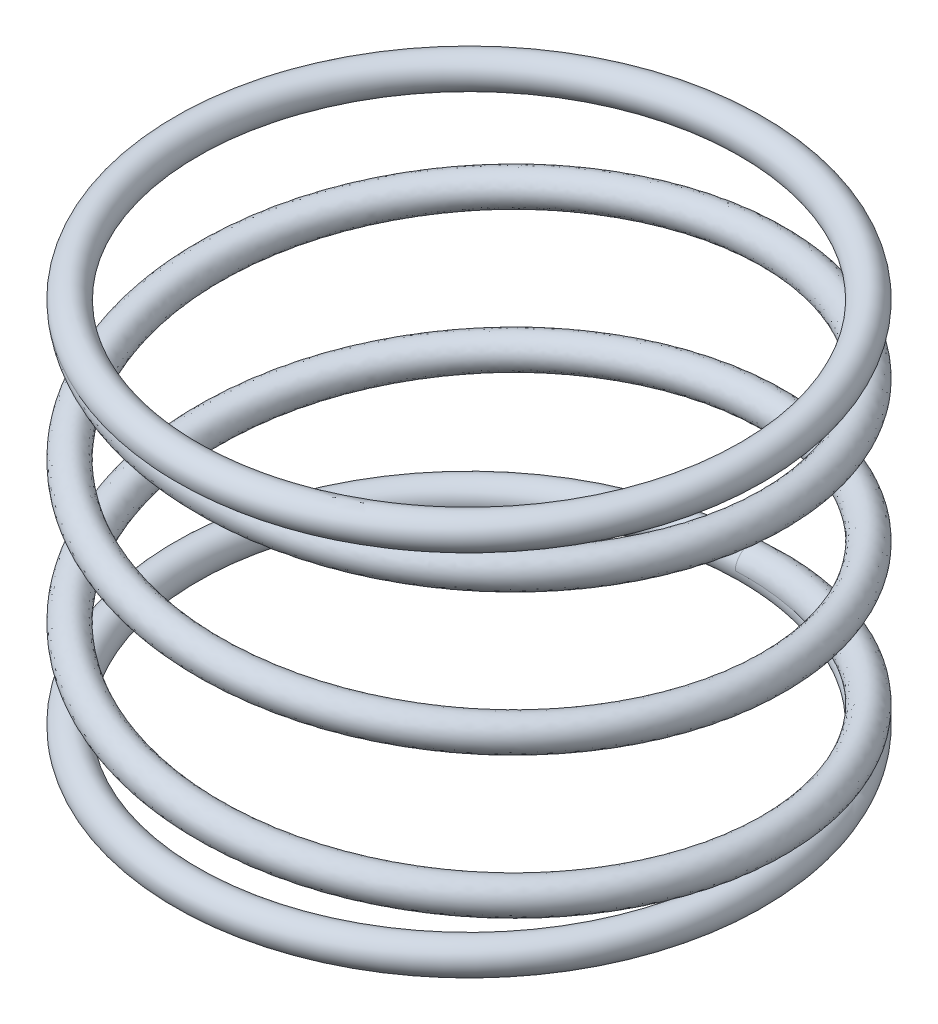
ISO-10303-21;
HEADER;
FILE_DESCRIPTION(('STEP AP214'),'2;1');
FILE_NAME('part.step','',(''),(''),'','','');
FILE_SCHEMA(('AUTOMOTIVE_DESIGN { 1 0 10303 214 1 1 1 1 }'));
ENDSEC;
DATA;
#1=APPLICATION_CONTEXT('core data for automotive mechanical design processes');
#2=APPLICATION_PROTOCOL_DEFINITION('international standard','automotive_design',2000,#1);
#3=PRODUCT_CONTEXT('',#1,'mechanical');
#4=PRODUCT('Part','Part','',(#3));
#5=PRODUCT_RELATED_PRODUCT_CATEGORY('part','',(#4));
#6=PRODUCT_DEFINITION_FORMATION('','',#4);
#7=PRODUCT_DEFINITION_CONTEXT('part definition',#1,'design');
#8=PRODUCT_DEFINITION('design','',#6,#7);
#9=PRODUCT_DEFINITION_SHAPE('','',#8);
#10=(LENGTH_UNIT() NAMED_UNIT(*) SI_UNIT(.MILLI.,.METRE.));
#11=(NAMED_UNIT(*) PLANE_ANGLE_UNIT() SI_UNIT($,.RADIAN.));
#12=(NAMED_UNIT(*) SI_UNIT($,.STERADIAN.) SOLID_ANGLE_UNIT());
#13=UNCERTAINTY_MEASURE_WITH_UNIT(LENGTH_MEASURE(1.E-05),#10,'distance_accuracy_value','');
#14=(GEOMETRIC_REPRESENTATION_CONTEXT(3) GLOBAL_UNCERTAINTY_ASSIGNED_CONTEXT((#13)) GLOBAL_UNIT_ASSIGNED_CONTEXT((#10,
#11,#12)) REPRESENTATION_CONTEXT('',''));
#15=CARTESIAN_POINT('',(0.,0.,0.));
#16=DIRECTION('',(0.,0.,1.));
#17=DIRECTION('',(1.,0.,0.));
#18=AXIS2_PLACEMENT_3D('',#15,#16,#17);
#19=CARTESIAN_POINT('',(-0.000939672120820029,-6.9071384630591E-05,-9.39799995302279));
#20=CARTESIAN_POINT('',(-0.000458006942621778,-3.36447573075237E-05,-9.39800000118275));
#21=CARTESIAN_POINT('',(2.36582379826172E-05,1.7808972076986E-06,-9.39799999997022));
#22=CARTESIAN_POINT('',(2.51821016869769,0.185210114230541,-9.39799366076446));
#23=CARTESIAN_POINT('',(4.69902048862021,0.370418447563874,-8.13889491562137));
#24=CARTESIAN_POINT('',(6.87983080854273,0.555626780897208,-6.87979617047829));
#25=CARTESIAN_POINT('',(8.13891857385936,0.740835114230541,-4.69897951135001));
#26=CARTESIAN_POINT('',(9.39800633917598,0.926043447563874,-2.51816285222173));
#27=CARTESIAN_POINT('',(9.39799999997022,1.11125178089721,2.36582379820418E-05));
#28=CARTESIAN_POINT('',(9.39799366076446,1.29646011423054,2.51821016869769));
#29=CARTESIAN_POINT('',(8.13889491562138,1.48166844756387,4.69902048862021));
#30=CARTESIAN_POINT('',(6.87979617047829,1.66687678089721,6.87983080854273));
#31=CARTESIAN_POINT('',(4.69897951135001,1.85208511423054,8.13891857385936));
#32=CARTESIAN_POINT('',(2.51816285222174,2.03729344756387,9.39800633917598));
#33=CARTESIAN_POINT('',(-2.36582379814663E-05,2.22250178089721,9.39799999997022));
#34=CARTESIAN_POINT('',(-2.51821016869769,2.40771011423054,9.39799366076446));
#35=CARTESIAN_POINT('',(-4.69902048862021,2.59291844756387,8.13889491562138));
#36=CARTESIAN_POINT('',(-6.87983080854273,2.77812678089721,6.87979617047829));
#37=CARTESIAN_POINT('',(-8.13891857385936,2.96333511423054,4.69897951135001));
#38=CARTESIAN_POINT('',(-9.39800633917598,3.14854344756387,2.51816285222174));
#39=CARTESIAN_POINT('',(-9.39799999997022,3.33375178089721,-2.36582379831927E-05));
#40=CARTESIAN_POINT('',(-9.39799366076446,3.51896011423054,-2.5182101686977));
#41=CARTESIAN_POINT('',(-8.13889491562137,3.70416844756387,-4.69902048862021));
#42=CARTESIAN_POINT('',(-6.87979617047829,3.88937678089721,-6.87983080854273));
#43=CARTESIAN_POINT('',(-4.69897951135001,4.07458511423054,-8.13891857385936));
#44=CARTESIAN_POINT('',(-2.51816285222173,4.25979344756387,-9.39800633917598));
#45=CARTESIAN_POINT('',(2.36582379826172E-05,4.44500178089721,-9.39799999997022));
#46=CARTESIAN_POINT('',(2.51821016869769,4.63021011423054,-9.39799366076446));
#47=CARTESIAN_POINT('',(4.69902048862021,4.81541844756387,-8.13889491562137));
#48=CARTESIAN_POINT('',(6.87983080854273,5.00062678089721,-6.87979617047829));
#49=CARTESIAN_POINT('',(8.13891857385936,5.18583511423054,-4.69897951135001));
#50=CARTESIAN_POINT('',(9.39800633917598,5.37104344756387,-2.51816285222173));
#51=CARTESIAN_POINT('',(9.39799999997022,5.55625178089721,2.36582379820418E-05));
#52=CARTESIAN_POINT('',(9.39799366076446,5.74146011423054,2.51821016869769));
#53=CARTESIAN_POINT('',(8.13889491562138,5.92666844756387,4.69902048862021));
#54=CARTESIAN_POINT('',(6.87979617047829,6.11187678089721,6.87983080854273));
#55=CARTESIAN_POINT('',(4.69897951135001,6.29708511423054,8.13891857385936));
#56=CARTESIAN_POINT('',(2.51816285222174,6.48229344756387,9.39800633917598));
#57=CARTESIAN_POINT('',(-2.36582379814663E-05,6.66750178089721,9.39799999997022));
#58=CARTESIAN_POINT('',(-2.51821016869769,6.85271011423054,9.39799366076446));
#59=CARTESIAN_POINT('',(-4.69902048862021,7.03791844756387,8.13889491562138));
#60=CARTESIAN_POINT('',(-6.87983080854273,7.22312678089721,6.87979617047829));
#61=CARTESIAN_POINT('',(-8.13891857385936,7.40833511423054,4.69897951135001));
#62=CARTESIAN_POINT('',(-9.39800633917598,7.59354344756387,2.51816285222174));
#63=CARTESIAN_POINT('',(-9.39799999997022,7.77875178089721,-2.36582379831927E-05));
#64=CARTESIAN_POINT('',(-9.39799366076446,7.96396011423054,-2.5182101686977));
#65=CARTESIAN_POINT('',(-8.13889491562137,8.14916844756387,-4.69902048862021));
#66=CARTESIAN_POINT('',(-6.87979617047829,8.33437678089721,-6.87983080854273));
#67=CARTESIAN_POINT('',(-4.69897951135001,8.51958511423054,-8.13891857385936));
#68=CARTESIAN_POINT('',(-2.51816285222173,8.70479344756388,-9.39800633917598));
#69=CARTESIAN_POINT('',(2.36582379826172E-05,8.89000178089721,-9.39799999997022));
#70=CARTESIAN_POINT('',(2.51821016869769,9.07521011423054,-9.39799366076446));
#71=CARTESIAN_POINT('',(4.69902048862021,9.26041844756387,-8.13889491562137));
#72=CARTESIAN_POINT('',(6.87983080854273,9.44562678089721,-6.87979617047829));
#73=CARTESIAN_POINT('',(8.13891857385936,9.63083511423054,-4.69897951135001));
#74=CARTESIAN_POINT('',(9.39800633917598,9.81604344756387,-2.51816285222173));
#75=CARTESIAN_POINT('',(9.39799999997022,10.0012517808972,2.36582379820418E-05));
#76=CARTESIAN_POINT('',(9.39799366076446,10.1864601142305,2.51821016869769));
#77=CARTESIAN_POINT('',(8.13889491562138,10.3716684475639,4.69902048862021));
#78=CARTESIAN_POINT('',(6.87979617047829,10.5568767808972,6.87983080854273));
#79=CARTESIAN_POINT('',(4.69897951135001,10.7420851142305,8.13891857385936));
#80=CARTESIAN_POINT('',(2.51816285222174,10.9272934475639,9.39800633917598));
#81=CARTESIAN_POINT('',(-2.36582379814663E-05,11.1125017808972,9.39799999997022));
#82=CARTESIAN_POINT('',(-2.51821016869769,11.2977101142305,9.39799366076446));
#83=CARTESIAN_POINT('',(-4.69902048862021,11.4829184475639,8.13889491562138));
#84=CARTESIAN_POINT('',(-5.30894634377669,11.5347172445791,7.78675201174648));
#85=CARTESIAN_POINT('',(-5.85957565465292,11.5880061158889,7.347637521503));
#86=CARTESIAN_POINT('',(-0.000939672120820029,1.01593092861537,-9.39799995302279));
#87=CARTESIAN_POINT('',(-0.000458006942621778,1.01596635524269,-9.39800000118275));
#88=CARTESIAN_POINT('',(2.36582379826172E-05,1.01600178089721,-9.39799999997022));
#89=CARTESIAN_POINT('',(2.51821016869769,1.20121011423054,-9.39799366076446));
#90=CARTESIAN_POINT('',(4.69902048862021,1.38641844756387,-8.13889491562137));
#91=CARTESIAN_POINT('',(6.87983080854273,1.57162678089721,-6.87979617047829));
#92=CARTESIAN_POINT('',(8.13891857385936,1.75683511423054,-4.69897951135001));
#93=CARTESIAN_POINT('',(9.39800633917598,1.94204344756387,-2.51816285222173));
#94=CARTESIAN_POINT('',(9.39799999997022,2.12725178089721,2.36582379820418E-05));
#95=CARTESIAN_POINT('',(9.39799366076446,2.31246011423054,2.51821016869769));
#96=CARTESIAN_POINT('',(8.13889491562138,2.49766844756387,4.69902048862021));
#97=CARTESIAN_POINT('',(6.87979617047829,2.68287678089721,6.87983080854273));
#98=CARTESIAN_POINT('',(4.69897951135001,2.86808511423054,8.13891857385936));
#99=CARTESIAN_POINT('',(2.51816285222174,3.05329344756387,9.39800633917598));
#100=CARTESIAN_POINT('',(-2.36582379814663E-05,3.23850178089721,9.39799999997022));
#101=CARTESIAN_POINT('',(-2.51821016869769,3.42371011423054,9.39799366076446));
#102=CARTESIAN_POINT('',(-4.69902048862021,3.60891844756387,8.13889491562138));
#103=CARTESIAN_POINT('',(-6.87983080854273,3.79412678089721,6.87979617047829));
#104=CARTESIAN_POINT('',(-8.13891857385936,3.97933511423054,4.69897951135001));
#105=CARTESIAN_POINT('',(-9.39800633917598,4.16454344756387,2.51816285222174));
#106=CARTESIAN_POINT('',(-9.39799999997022,4.34975178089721,-2.36582379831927E-05));
#107=CARTESIAN_POINT('',(-9.39799366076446,4.53496011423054,-2.5182101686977));
#108=CARTESIAN_POINT('',(-8.13889491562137,4.72016844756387,-4.69902048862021));
#109=CARTESIAN_POINT('',(-6.87979617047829,4.90537678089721,-6.87983080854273));
#110=CARTESIAN_POINT('',(-4.69897951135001,5.09058511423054,-8.13891857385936));
#111=CARTESIAN_POINT('',(-2.51816285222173,5.27579344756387,-9.39800633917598));
#112=CARTESIAN_POINT('',(2.36582379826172E-05,5.46100178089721,-9.39799999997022));
#113=CARTESIAN_POINT('',(2.51821016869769,5.64621011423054,-9.39799366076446));
#114=CARTESIAN_POINT('',(4.69902048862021,5.83141844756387,-8.13889491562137));
#115=CARTESIAN_POINT('',(6.87983080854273,6.01662678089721,-6.87979617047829));
#116=CARTESIAN_POINT('',(8.13891857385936,6.20183511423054,-4.69897951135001));
#117=CARTESIAN_POINT('',(9.39800633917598,6.38704344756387,-2.51816285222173));
#118=CARTESIAN_POINT('',(9.39799999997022,6.57225178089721,2.36582379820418E-05));
#119=CARTESIAN_POINT('',(9.39799366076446,6.75746011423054,2.51821016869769));
#120=CARTESIAN_POINT('',(8.13889491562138,6.94266844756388,4.69902048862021));
#121=CARTESIAN_POINT('',(6.87979617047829,7.12787678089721,6.87983080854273));
#122=CARTESIAN_POINT('',(4.69897951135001,7.31308511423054,8.13891857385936));
#123=CARTESIAN_POINT('',(2.51816285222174,7.49829344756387,9.39800633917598));
#124=CARTESIAN_POINT('',(-2.36582379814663E-05,7.68350178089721,9.39799999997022));
#125=CARTESIAN_POINT('',(-2.51821016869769,7.86871011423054,9.39799366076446));
#126=CARTESIAN_POINT('',(-4.69902048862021,8.05391844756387,8.13889491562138));
#127=CARTESIAN_POINT('',(-6.87983080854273,8.23912678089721,6.87979617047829));
#128=CARTESIAN_POINT('',(-8.13891857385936,8.42433511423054,4.69897951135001));
#129=CARTESIAN_POINT('',(-9.39800633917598,8.60954344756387,2.51816285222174));
#130=CARTESIAN_POINT('',(-9.39799999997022,8.79475178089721,-2.36582379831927E-05));
#131=CARTESIAN_POINT('',(-9.39799366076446,8.97996011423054,-2.5182101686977));
#132=CARTESIAN_POINT('',(-8.13889491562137,9.16516844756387,-4.69902048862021));
#133=CARTESIAN_POINT('',(-6.87979617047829,9.35037678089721,-6.87983080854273));
#134=CARTESIAN_POINT('',(-4.69897951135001,9.53558511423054,-8.13891857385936));
#135=CARTESIAN_POINT('',(-2.51816285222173,9.72079344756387,-9.39800633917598));
#136=CARTESIAN_POINT('',(2.36582379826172E-05,9.90600178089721,-9.39799999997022));
#137=CARTESIAN_POINT('',(2.51821016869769,10.0912101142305,-9.39799366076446));
#138=CARTESIAN_POINT('',(4.69902048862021,10.2764184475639,-8.13889491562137));
#139=CARTESIAN_POINT('',(6.87983080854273,10.4616267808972,-6.87979617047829));
#140=CARTESIAN_POINT('',(8.13891857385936,10.6468351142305,-4.69897951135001));
#141=CARTESIAN_POINT('',(9.39800633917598,10.8320434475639,-2.51816285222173));
#142=CARTESIAN_POINT('',(9.39799999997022,11.0172517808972,2.36582379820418E-05));
#143=CARTESIAN_POINT('',(9.39799366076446,11.2024601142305,2.51821016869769));
#144=CARTESIAN_POINT('',(8.13889491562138,11.3876684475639,4.69902048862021));
#145=CARTESIAN_POINT('',(6.87979617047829,11.5728767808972,6.87983080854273));
#146=CARTESIAN_POINT('',(4.69897951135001,11.7580851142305,8.13891857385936));
#147=CARTESIAN_POINT('',(2.51816285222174,11.9432934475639,9.39800633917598));
#148=CARTESIAN_POINT('',(-2.36582379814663E-05,12.1285017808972,9.39799999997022));
#149=CARTESIAN_POINT('',(-2.51821016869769,12.3137101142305,9.39799366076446));
#150=CARTESIAN_POINT('',(-4.69902048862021,12.4989184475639,8.13889491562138));
#151=CARTESIAN_POINT('',(-5.30894634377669,12.5507172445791,7.78675201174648));
#152=CARTESIAN_POINT('',(-5.85957565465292,12.6040061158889,7.347637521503));
#153=CARTESIAN_POINT('',(-0.000838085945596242,1.01593092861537,-8.38199995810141));
#154=CARTESIAN_POINT('',(-0.000408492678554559,1.01596635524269,-8.38200000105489));
#155=CARTESIAN_POINT('',(2.11005906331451E-05,1.01600178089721,-8.38199999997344));
#156=CARTESIAN_POINT('',(2.24597123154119,1.20121011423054,-8.38199434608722));
#157=CARTESIAN_POINT('',(4.19101827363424,1.38641844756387,-7.25901438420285));
#158=CARTESIAN_POINT('',(6.1360653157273,1.57162678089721,-6.13603442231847));
#159=CARTESIAN_POINT('',(7.25903548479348,1.75683511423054,-4.1909817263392));
#160=CARTESIAN_POINT('',(8.38200565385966,1.94204344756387,-2.24592903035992));
#161=CARTESIAN_POINT('',(8.38199999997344,2.12725178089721,2.11005906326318E-05));
#162=CARTESIAN_POINT('',(8.38199434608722,2.31246011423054,2.24597123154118));
#163=CARTESIAN_POINT('',(7.25901438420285,2.49766844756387,4.19101827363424));
#164=CARTESIAN_POINT('',(6.13603442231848,2.68287678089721,6.1360653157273));
#165=CARTESIAN_POINT('',(4.1909817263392,2.86808511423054,7.25903548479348));
#166=CARTESIAN_POINT('',(2.24592903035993,3.05329344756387,8.38200565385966));
#167=CARTESIAN_POINT('',(-2.11005906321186E-05,3.23850178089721,8.38199999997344));
#168=CARTESIAN_POINT('',(-2.24597123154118,3.42371011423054,8.38199434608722));
#169=CARTESIAN_POINT('',(-4.19101827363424,3.60891844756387,7.25901438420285));
#170=CARTESIAN_POINT('',(-6.1360653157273,3.79412678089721,6.13603442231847));
#171=CARTESIAN_POINT('',(-7.25903548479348,3.97933511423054,4.1909817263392));
#172=CARTESIAN_POINT('',(-8.38200565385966,4.16454344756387,2.24592903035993));
#173=CARTESIAN_POINT('',(-8.38199999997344,4.34975178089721,-2.11005906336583E-05));
#174=CARTESIAN_POINT('',(-8.38199434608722,4.53496011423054,-2.24597123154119));
#175=CARTESIAN_POINT('',(-7.25901438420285,4.72016844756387,-4.19101827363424));
#176=CARTESIAN_POINT('',(-6.13603442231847,4.90537678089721,-6.1360653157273));
#177=CARTESIAN_POINT('',(-4.1909817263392,5.09058511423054,-7.25903548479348));
#178=CARTESIAN_POINT('',(-2.24592903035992,5.27579344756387,-8.38200565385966));
#179=CARTESIAN_POINT('',(2.11005906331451E-05,5.46100178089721,-8.38199999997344));
#180=CARTESIAN_POINT('',(2.24597123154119,5.64621011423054,-8.38199434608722));
#181=CARTESIAN_POINT('',(4.19101827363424,5.83141844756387,-7.25901438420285));
#182=CARTESIAN_POINT('',(6.1360653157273,6.01662678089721,-6.13603442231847));
#183=CARTESIAN_POINT('',(7.25903548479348,6.20183511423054,-4.1909817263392));
#184=CARTESIAN_POINT('',(8.38200565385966,6.38704344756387,-2.24592903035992));
#185=CARTESIAN_POINT('',(8.38199999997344,6.57225178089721,2.11005906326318E-05));
#186=CARTESIAN_POINT('',(8.38199434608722,6.75746011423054,2.24597123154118));
#187=CARTESIAN_POINT('',(7.25901438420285,6.94266844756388,4.19101827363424));
#188=CARTESIAN_POINT('',(6.13603442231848,7.12787678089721,6.1360653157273));
#189=CARTESIAN_POINT('',(4.1909817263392,7.31308511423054,7.25903548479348));
#190=CARTESIAN_POINT('',(2.24592903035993,7.49829344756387,8.38200565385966));
#191=CARTESIAN_POINT('',(-2.11005906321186E-05,7.68350178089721,8.38199999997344));
#192=CARTESIAN_POINT('',(-2.24597123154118,7.86871011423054,8.38199434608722));
#193=CARTESIAN_POINT('',(-4.19101827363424,8.05391844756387,7.25901438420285));
#194=CARTESIAN_POINT('',(-6.1360653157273,8.23912678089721,6.13603442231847));
#195=CARTESIAN_POINT('',(-7.25903548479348,8.42433511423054,4.1909817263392));
#196=CARTESIAN_POINT('',(-8.38200565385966,8.60954344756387,2.24592903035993));
#197=CARTESIAN_POINT('',(-8.38199999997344,8.79475178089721,-2.11005906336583E-05));
#198=CARTESIAN_POINT('',(-8.38199434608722,8.97996011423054,-2.24597123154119));
#199=CARTESIAN_POINT('',(-7.25901438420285,9.16516844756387,-4.19101827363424));
#200=CARTESIAN_POINT('',(-6.13603442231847,9.35037678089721,-6.1360653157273));
#201=CARTESIAN_POINT('',(-4.1909817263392,9.53558511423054,-7.25903548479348));
#202=CARTESIAN_POINT('',(-2.24592903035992,9.72079344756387,-8.38200565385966));
#203=CARTESIAN_POINT('',(2.11005906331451E-05,9.90600178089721,-8.38199999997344));
#204=CARTESIAN_POINT('',(2.24597123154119,10.0912101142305,-8.38199434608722));
#205=CARTESIAN_POINT('',(4.19101827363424,10.2764184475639,-7.25901438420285));
#206=CARTESIAN_POINT('',(6.1360653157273,10.4616267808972,-6.13603442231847));
#207=CARTESIAN_POINT('',(7.25903548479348,10.6468351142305,-4.1909817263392));
#208=CARTESIAN_POINT('',(8.38200565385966,10.8320434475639,-2.24592903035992));
#209=CARTESIAN_POINT('',(8.38199999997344,11.0172517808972,2.11005906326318E-05));
#210=CARTESIAN_POINT('',(8.38199434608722,11.2024601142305,2.24597123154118));
#211=CARTESIAN_POINT('',(7.25901438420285,11.3876684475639,4.19101827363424));
#212=CARTESIAN_POINT('',(6.13603442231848,11.5728767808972,6.1360653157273));
#213=CARTESIAN_POINT('',(4.1909817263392,11.7580851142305,7.25903548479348));
#214=CARTESIAN_POINT('',(2.24592903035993,11.9432934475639,8.38200565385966));
#215=CARTESIAN_POINT('',(-2.11005906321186E-05,12.1285017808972,8.38199999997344));
#216=CARTESIAN_POINT('',(-2.24597123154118,12.3137101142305,8.38199434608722));
#217=CARTESIAN_POINT('',(-4.19101827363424,12.4989184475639,7.25901438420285));
#218=CARTESIAN_POINT('',(-4.73500619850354,12.5507172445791,6.94494098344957));
#219=CARTESIAN_POINT('',(-5.22610801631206,12.6040061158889,6.55329832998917));
#220=CARTESIAN_POINT('',(-0.000838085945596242,-6.9071384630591E-05,-8.38199995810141));
#221=CARTESIAN_POINT('',(-0.000408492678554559,-3.36447573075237E-05,-8.38200000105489));
#222=CARTESIAN_POINT('',(2.11005906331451E-05,1.7808972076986E-06,-8.38199999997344));
#223=CARTESIAN_POINT('',(2.24597123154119,0.185210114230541,-8.38199434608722));
#224=CARTESIAN_POINT('',(4.19101827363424,0.370418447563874,-7.25901438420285));
#225=CARTESIAN_POINT('',(6.1360653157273,0.555626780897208,-6.13603442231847));
#226=CARTESIAN_POINT('',(7.25903548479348,0.740835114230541,-4.1909817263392));
#227=CARTESIAN_POINT('',(8.38200565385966,0.926043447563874,-2.24592903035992));
#228=CARTESIAN_POINT('',(8.38199999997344,1.11125178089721,2.11005906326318E-05));
#229=CARTESIAN_POINT('',(8.38199434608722,1.29646011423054,2.24597123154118));
#230=CARTESIAN_POINT('',(7.25901438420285,1.48166844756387,4.19101827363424));
#231=CARTESIAN_POINT('',(6.13603442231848,1.66687678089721,6.1360653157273));
#232=CARTESIAN_POINT('',(4.1909817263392,1.85208511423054,7.25903548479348));
#233=CARTESIAN_POINT('',(2.24592903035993,2.03729344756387,8.38200565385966));
#234=CARTESIAN_POINT('',(-2.11005906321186E-05,2.22250178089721,8.38199999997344));
#235=CARTESIAN_POINT('',(-2.24597123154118,2.40771011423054,8.38199434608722));
#236=CARTESIAN_POINT('',(-4.19101827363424,2.59291844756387,7.25901438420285));
#237=CARTESIAN_POINT('',(-6.1360653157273,2.77812678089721,6.13603442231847));
#238=CARTESIAN_POINT('',(-7.25903548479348,2.96333511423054,4.1909817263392));
#239=CARTESIAN_POINT('',(-8.38200565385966,3.14854344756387,2.24592903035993));
#240=CARTESIAN_POINT('',(-8.38199999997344,3.33375178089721,-2.11005906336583E-05));
#241=CARTESIAN_POINT('',(-8.38199434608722,3.51896011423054,-2.24597123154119));
#242=CARTESIAN_POINT('',(-7.25901438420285,3.70416844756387,-4.19101827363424));
#243=CARTESIAN_POINT('',(-6.13603442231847,3.88937678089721,-6.1360653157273));
#244=CARTESIAN_POINT('',(-4.1909817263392,4.07458511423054,-7.25903548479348));
#245=CARTESIAN_POINT('',(-2.24592903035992,4.25979344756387,-8.38200565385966));
#246=CARTESIAN_POINT('',(2.11005906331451E-05,4.44500178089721,-8.38199999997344));
#247=CARTESIAN_POINT('',(2.24597123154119,4.63021011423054,-8.38199434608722));
#248=CARTESIAN_POINT('',(4.19101827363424,4.81541844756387,-7.25901438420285));
#249=CARTESIAN_POINT('',(6.1360653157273,5.00062678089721,-6.13603442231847));
#250=CARTESIAN_POINT('',(7.25903548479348,5.18583511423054,-4.1909817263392));
#251=CARTESIAN_POINT('',(8.38200565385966,5.37104344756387,-2.24592903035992));
#252=CARTESIAN_POINT('',(8.38199999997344,5.55625178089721,2.11005906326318E-05));
#253=CARTESIAN_POINT('',(8.38199434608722,5.74146011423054,2.24597123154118));
#254=CARTESIAN_POINT('',(7.25901438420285,5.92666844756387,4.19101827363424));
#255=CARTESIAN_POINT('',(6.13603442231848,6.11187678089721,6.1360653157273));
#256=CARTESIAN_POINT('',(4.1909817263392,6.29708511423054,7.25903548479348));
#257=CARTESIAN_POINT('',(2.24592903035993,6.48229344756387,8.38200565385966));
#258=CARTESIAN_POINT('',(-2.11005906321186E-05,6.66750178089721,8.38199999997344));
#259=CARTESIAN_POINT('',(-2.24597123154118,6.85271011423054,8.38199434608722));
#260=CARTESIAN_POINT('',(-4.19101827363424,7.03791844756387,7.25901438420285));
#261=CARTESIAN_POINT('',(-6.1360653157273,7.22312678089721,6.13603442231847));
#262=CARTESIAN_POINT('',(-7.25903548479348,7.40833511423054,4.1909817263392));
#263=CARTESIAN_POINT('',(-8.38200565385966,7.59354344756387,2.24592903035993));
#264=CARTESIAN_POINT('',(-8.38199999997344,7.77875178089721,-2.11005906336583E-05));
#265=CARTESIAN_POINT('',(-8.38199434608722,7.96396011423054,-2.24597123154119));
#266=CARTESIAN_POINT('',(-7.25901438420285,8.14916844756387,-4.19101827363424));
#267=CARTESIAN_POINT('',(-6.13603442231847,8.33437678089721,-6.1360653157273));
#268=CARTESIAN_POINT('',(-4.1909817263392,8.51958511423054,-7.25903548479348));
#269=CARTESIAN_POINT('',(-2.24592903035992,8.70479344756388,-8.38200565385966));
#270=CARTESIAN_POINT('',(2.11005906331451E-05,8.89000178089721,-8.38199999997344));
#271=CARTESIAN_POINT('',(2.24597123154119,9.07521011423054,-8.38199434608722));
#272=CARTESIAN_POINT('',(4.19101827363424,9.26041844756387,-7.25901438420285));
#273=CARTESIAN_POINT('',(6.1360653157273,9.44562678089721,-6.13603442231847));
#274=CARTESIAN_POINT('',(7.25903548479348,9.63083511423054,-4.1909817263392));
#275=CARTESIAN_POINT('',(8.38200565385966,9.81604344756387,-2.24592903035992));
#276=CARTESIAN_POINT('',(8.38199999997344,10.0012517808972,2.11005906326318E-05));
#277=CARTESIAN_POINT('',(8.38199434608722,10.1864601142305,2.24597123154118));
#278=CARTESIAN_POINT('',(7.25901438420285,10.3716684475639,4.19101827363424));
#279=CARTESIAN_POINT('',(6.13603442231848,10.5568767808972,6.1360653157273));
#280=CARTESIAN_POINT('',(4.1909817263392,10.7420851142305,7.25903548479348));
#281=CARTESIAN_POINT('',(2.24592903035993,10.9272934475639,8.38200565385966));
#282=CARTESIAN_POINT('',(-2.11005906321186E-05,11.1125017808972,8.38199999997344));
#283=CARTESIAN_POINT('',(-2.24597123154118,11.2977101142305,8.38199434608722));
#284=CARTESIAN_POINT('',(-4.19101827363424,11.4829184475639,7.25901438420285));
#285=CARTESIAN_POINT('',(-4.73500619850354,11.5347172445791,6.94494098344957));
#286=CARTESIAN_POINT('',(-5.22610801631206,11.5880061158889,6.55329832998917));
#287=CARTESIAN_POINT('',(-0.000838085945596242,-1.01606907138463,-8.38199995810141));
#288=CARTESIAN_POINT('',(-0.000408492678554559,-1.01603364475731,-8.38200000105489));
#289=CARTESIAN_POINT('',(2.11005906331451E-05,-1.01599821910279,-8.38199999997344));
#290=CARTESIAN_POINT('',(2.24597123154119,-0.830789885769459,-8.38199434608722));
#291=CARTESIAN_POINT('',(4.19101827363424,-0.645581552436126,-7.25901438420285));
#292=CARTESIAN_POINT('',(6.1360653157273,-0.460373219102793,-6.13603442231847));
#293=CARTESIAN_POINT('',(7.25903548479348,-0.275164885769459,-4.1909817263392));
#294=CARTESIAN_POINT('',(8.38200565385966,-0.0899565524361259,-2.24592903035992));
#295=CARTESIAN_POINT('',(8.38199999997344,0.0952517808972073,2.11005906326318E-05));
#296=CARTESIAN_POINT('',(8.38199434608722,0.280460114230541,2.24597123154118));
#297=CARTESIAN_POINT('',(7.25901438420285,0.465668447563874,4.19101827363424));
#298=CARTESIAN_POINT('',(6.13603442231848,0.650876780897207,6.1360653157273));
#299=CARTESIAN_POINT('',(4.1909817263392,0.836085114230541,7.25903548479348));
#300=CARTESIAN_POINT('',(2.24592903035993,1.02129344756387,8.38200565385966));
#301=CARTESIAN_POINT('',(-2.11005906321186E-05,1.20650178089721,8.38199999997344));
#302=CARTESIAN_POINT('',(-2.24597123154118,1.39171011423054,8.38199434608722));
#303=CARTESIAN_POINT('',(-4.19101827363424,1.57691844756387,7.25901438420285));
#304=CARTESIAN_POINT('',(-6.1360653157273,1.76212678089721,6.13603442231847));
#305=CARTESIAN_POINT('',(-7.25903548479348,1.94733511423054,4.1909817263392));
#306=CARTESIAN_POINT('',(-8.38200565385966,2.13254344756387,2.24592903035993));
#307=CARTESIAN_POINT('',(-8.38199999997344,2.31775178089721,-2.11005906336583E-05));
#308=CARTESIAN_POINT('',(-8.38199434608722,2.50296011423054,-2.24597123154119));
#309=CARTESIAN_POINT('',(-7.25901438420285,2.68816844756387,-4.19101827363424));
#310=CARTESIAN_POINT('',(-6.13603442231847,2.87337678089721,-6.1360653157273));
#311=CARTESIAN_POINT('',(-4.1909817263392,3.05858511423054,-7.25903548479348));
#312=CARTESIAN_POINT('',(-2.24592903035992,3.24379344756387,-8.38200565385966));
#313=CARTESIAN_POINT('',(2.11005906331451E-05,3.42900178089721,-8.38199999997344));
#314=CARTESIAN_POINT('',(2.24597123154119,3.61421011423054,-8.38199434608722));
#315=CARTESIAN_POINT('',(4.19101827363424,3.79941844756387,-7.25901438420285));
#316=CARTESIAN_POINT('',(6.1360653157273,3.98462678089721,-6.13603442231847));
#317=CARTESIAN_POINT('',(7.25903548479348,4.16983511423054,-4.1909817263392));
#318=CARTESIAN_POINT('',(8.38200565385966,4.35504344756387,-2.24592903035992));
#319=CARTESIAN_POINT('',(8.38199999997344,4.54025178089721,2.11005906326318E-05));
#320=CARTESIAN_POINT('',(8.38199434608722,4.72546011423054,2.24597123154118));
#321=CARTESIAN_POINT('',(7.25901438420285,4.91066844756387,4.19101827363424));
#322=CARTESIAN_POINT('',(6.13603442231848,5.09587678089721,6.1360653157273));
#323=CARTESIAN_POINT('',(4.1909817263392,5.28108511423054,7.25903548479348));
#324=CARTESIAN_POINT('',(2.24592903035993,5.46629344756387,8.38200565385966));
#325=CARTESIAN_POINT('',(-2.11005906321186E-05,5.65150178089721,8.38199999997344));
#326=CARTESIAN_POINT('',(-2.24597123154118,5.83671011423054,8.38199434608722));
#327=CARTESIAN_POINT('',(-4.19101827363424,6.02191844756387,7.25901438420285));
#328=CARTESIAN_POINT('',(-6.1360653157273,6.20712678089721,6.13603442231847));
#329=CARTESIAN_POINT('',(-7.25903548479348,6.39233511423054,4.1909817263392));
#330=CARTESIAN_POINT('',(-8.38200565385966,6.57754344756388,2.24592903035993));
#331=CARTESIAN_POINT('',(-8.38199999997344,6.76275178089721,-2.11005906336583E-05));
#332=CARTESIAN_POINT('',(-8.38199434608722,6.94796011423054,-2.24597123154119));
#333=CARTESIAN_POINT('',(-7.25901438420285,7.13316844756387,-4.19101827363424));
#334=CARTESIAN_POINT('',(-6.13603442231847,7.31837678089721,-6.1360653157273));
#335=CARTESIAN_POINT('',(-4.1909817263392,7.50358511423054,-7.25903548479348));
#336=CARTESIAN_POINT('',(-2.24592903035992,7.68879344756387,-8.38200565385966));
#337=CARTESIAN_POINT('',(2.11005906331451E-05,7.87400178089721,-8.38199999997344));
#338=CARTESIAN_POINT('',(2.24597123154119,8.05921011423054,-8.38199434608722));
#339=CARTESIAN_POINT('',(4.19101827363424,8.24441844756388,-7.25901438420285));
#340=CARTESIAN_POINT('',(6.1360653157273,8.42962678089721,-6.13603442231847));
#341=CARTESIAN_POINT('',(7.25903548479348,8.61483511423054,-4.1909817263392));
#342=CARTESIAN_POINT('',(8.38200565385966,8.80004344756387,-2.24592903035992));
#343=CARTESIAN_POINT('',(8.38199999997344,8.98525178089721,2.11005906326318E-05));
#344=CARTESIAN_POINT('',(8.38199434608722,9.17046011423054,2.24597123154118));
#345=CARTESIAN_POINT('',(7.25901438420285,9.35566844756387,4.19101827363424));
#346=CARTESIAN_POINT('',(6.13603442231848,9.54087678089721,6.1360653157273));
#347=CARTESIAN_POINT('',(4.1909817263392,9.72608511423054,7.25903548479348));
#348=CARTESIAN_POINT('',(2.24592903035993,9.91129344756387,8.38200565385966));
#349=CARTESIAN_POINT('',(-2.11005906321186E-05,10.0965017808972,8.38199999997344));
#350=CARTESIAN_POINT('',(-2.24597123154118,10.2817101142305,8.38199434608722));
#351=CARTESIAN_POINT('',(-4.19101827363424,10.4669184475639,7.25901438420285));
#352=CARTESIAN_POINT('',(-4.73500619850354,10.5187172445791,6.94494098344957));
#353=CARTESIAN_POINT('',(-5.22610801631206,10.5720061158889,6.55329832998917));
#354=CARTESIAN_POINT('',(-0.000939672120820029,-1.01606907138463,-9.39799995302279));
#355=CARTESIAN_POINT('',(-0.000458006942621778,-1.01603364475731,-9.39800000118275));
#356=CARTESIAN_POINT('',(2.36582379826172E-05,-1.01599821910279,-9.39799999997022));
#357=CARTESIAN_POINT('',(2.51821016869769,-0.830789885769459,-9.39799366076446));
#358=CARTESIAN_POINT('',(4.69902048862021,-0.645581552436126,-8.13889491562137));
#359=CARTESIAN_POINT('',(6.87983080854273,-0.460373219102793,-6.87979617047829));
#360=CARTESIAN_POINT('',(8.13891857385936,-0.275164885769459,-4.69897951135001));
#361=CARTESIAN_POINT('',(9.39800633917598,-0.0899565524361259,-2.51816285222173));
#362=CARTESIAN_POINT('',(9.39799999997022,0.0952517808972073,2.36582379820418E-05));
#363=CARTESIAN_POINT('',(9.39799366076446,0.280460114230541,2.51821016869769));
#364=CARTESIAN_POINT('',(8.13889491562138,0.465668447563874,4.69902048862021));
#365=CARTESIAN_POINT('',(6.87979617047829,0.650876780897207,6.87983080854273));
#366=CARTESIAN_POINT('',(4.69897951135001,0.836085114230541,8.13891857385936));
#367=CARTESIAN_POINT('',(2.51816285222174,1.02129344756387,9.39800633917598));
#368=CARTESIAN_POINT('',(-2.36582379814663E-05,1.20650178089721,9.39799999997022));
#369=CARTESIAN_POINT('',(-2.51821016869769,1.39171011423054,9.39799366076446));
#370=CARTESIAN_POINT('',(-4.69902048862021,1.57691844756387,8.13889491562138));
#371=CARTESIAN_POINT('',(-6.87983080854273,1.76212678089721,6.87979617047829));
#372=CARTESIAN_POINT('',(-8.13891857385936,1.94733511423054,4.69897951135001));
#373=CARTESIAN_POINT('',(-9.39800633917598,2.13254344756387,2.51816285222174));
#374=CARTESIAN_POINT('',(-9.39799999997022,2.31775178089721,-2.36582379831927E-05));
#375=CARTESIAN_POINT('',(-9.39799366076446,2.50296011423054,-2.5182101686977));
#376=CARTESIAN_POINT('',(-8.13889491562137,2.68816844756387,-4.69902048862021));
#377=CARTESIAN_POINT('',(-6.87979617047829,2.87337678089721,-6.87983080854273));
#378=CARTESIAN_POINT('',(-4.69897951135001,3.05858511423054,-8.13891857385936));
#379=CARTESIAN_POINT('',(-2.51816285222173,3.24379344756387,-9.39800633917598));
#380=CARTESIAN_POINT('',(2.36582379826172E-05,3.42900178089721,-9.39799999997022));
#381=CARTESIAN_POINT('',(2.51821016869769,3.61421011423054,-9.39799366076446));
#382=CARTESIAN_POINT('',(4.69902048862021,3.79941844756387,-8.13889491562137));
#383=CARTESIAN_POINT('',(6.87983080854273,3.98462678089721,-6.87979617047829));
#384=CARTESIAN_POINT('',(8.13891857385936,4.16983511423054,-4.69897951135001));
#385=CARTESIAN_POINT('',(9.39800633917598,4.35504344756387,-2.51816285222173));
#386=CARTESIAN_POINT('',(9.39799999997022,4.54025178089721,2.36582379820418E-05));
#387=CARTESIAN_POINT('',(9.39799366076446,4.72546011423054,2.51821016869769));
#388=CARTESIAN_POINT('',(8.13889491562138,4.91066844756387,4.69902048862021));
#389=CARTESIAN_POINT('',(6.87979617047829,5.09587678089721,6.87983080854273));
#390=CARTESIAN_POINT('',(4.69897951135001,5.28108511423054,8.13891857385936));
#391=CARTESIAN_POINT('',(2.51816285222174,5.46629344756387,9.39800633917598));
#392=CARTESIAN_POINT('',(-2.36582379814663E-05,5.65150178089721,9.39799999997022));
#393=CARTESIAN_POINT('',(-2.51821016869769,5.83671011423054,9.39799366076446));
#394=CARTESIAN_POINT('',(-4.69902048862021,6.02191844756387,8.13889491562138));
#395=CARTESIAN_POINT('',(-6.87983080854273,6.20712678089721,6.87979617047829));
#396=CARTESIAN_POINT('',(-8.13891857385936,6.39233511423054,4.69897951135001));
#397=CARTESIAN_POINT('',(-9.39800633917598,6.57754344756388,2.51816285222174));
#398=CARTESIAN_POINT('',(-9.39799999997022,6.76275178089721,-2.36582379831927E-05));
#399=CARTESIAN_POINT('',(-9.39799366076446,6.94796011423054,-2.5182101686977));
#400=CARTESIAN_POINT('',(-8.13889491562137,7.13316844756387,-4.69902048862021));
#401=CARTESIAN_POINT('',(-6.87979617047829,7.31837678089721,-6.87983080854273));
#402=CARTESIAN_POINT('',(-4.69897951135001,7.50358511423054,-8.13891857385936));
#403=CARTESIAN_POINT('',(-2.51816285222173,7.68879344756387,-9.39800633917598));
#404=CARTESIAN_POINT('',(2.36582379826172E-05,7.87400178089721,-9.39799999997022));
#405=CARTESIAN_POINT('',(2.51821016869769,8.05921011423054,-9.39799366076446));
#406=CARTESIAN_POINT('',(4.69902048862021,8.24441844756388,-8.13889491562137));
#407=CARTESIAN_POINT('',(6.87983080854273,8.42962678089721,-6.87979617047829));
#408=CARTESIAN_POINT('',(8.13891857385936,8.61483511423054,-4.69897951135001));
#409=CARTESIAN_POINT('',(9.39800633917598,8.80004344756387,-2.51816285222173));
#410=CARTESIAN_POINT('',(9.39799999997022,8.98525178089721,2.36582379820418E-05));
#411=CARTESIAN_POINT('',(9.39799366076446,9.17046011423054,2.51821016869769));
#412=CARTESIAN_POINT('',(8.13889491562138,9.35566844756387,4.69902048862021));
#413=CARTESIAN_POINT('',(6.87979617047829,9.54087678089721,6.87983080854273));
#414=CARTESIAN_POINT('',(4.69897951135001,9.72608511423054,8.13891857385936));
#415=CARTESIAN_POINT('',(2.51816285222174,9.91129344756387,9.39800633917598));
#416=CARTESIAN_POINT('',(-2.36582379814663E-05,10.0965017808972,9.39799999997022));
#417=CARTESIAN_POINT('',(-2.51821016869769,10.2817101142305,9.39799366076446));
#418=CARTESIAN_POINT('',(-4.69902048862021,10.4669184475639,8.13889491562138));
#419=CARTESIAN_POINT('',(-5.30894634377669,10.5187172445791,7.78675201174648));
#420=CARTESIAN_POINT('',(-5.85957565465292,10.5720061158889,7.347637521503));
#421=CARTESIAN_POINT('',(-0.000939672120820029,-6.9071384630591E-05,-9.39799995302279));
#422=CARTESIAN_POINT('',(-0.000458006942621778,-3.36447573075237E-05,-9.39800000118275));
#423=CARTESIAN_POINT('',(2.36582379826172E-05,1.7808972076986E-06,-9.39799999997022));
#424=CARTESIAN_POINT('',(2.51821016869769,0.185210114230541,-9.39799366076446));
#425=CARTESIAN_POINT('',(4.69902048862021,0.370418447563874,-8.13889491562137));
#426=CARTESIAN_POINT('',(6.87983080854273,0.555626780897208,-6.87979617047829));
#427=CARTESIAN_POINT('',(8.13891857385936,0.740835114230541,-4.69897951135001));
#428=CARTESIAN_POINT('',(9.39800633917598,0.926043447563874,-2.51816285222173));
#429=CARTESIAN_POINT('',(9.39799999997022,1.11125178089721,2.36582379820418E-05));
#430=CARTESIAN_POINT('',(9.39799366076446,1.29646011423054,2.51821016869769));
#431=CARTESIAN_POINT('',(8.13889491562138,1.48166844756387,4.69902048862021));
#432=CARTESIAN_POINT('',(6.87979617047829,1.66687678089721,6.87983080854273));
#433=CARTESIAN_POINT('',(4.69897951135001,1.85208511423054,8.13891857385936));
#434=CARTESIAN_POINT('',(2.51816285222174,2.03729344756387,9.39800633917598));
#435=CARTESIAN_POINT('',(-2.36582379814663E-05,2.22250178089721,9.39799999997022));
#436=CARTESIAN_POINT('',(-2.51821016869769,2.40771011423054,9.39799366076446));
#437=CARTESIAN_POINT('',(-4.69902048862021,2.59291844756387,8.13889491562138));
#438=CARTESIAN_POINT('',(-6.87983080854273,2.77812678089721,6.87979617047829));
#439=CARTESIAN_POINT('',(-8.13891857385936,2.96333511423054,4.69897951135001));
#440=CARTESIAN_POINT('',(-9.39800633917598,3.14854344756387,2.51816285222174));
#441=CARTESIAN_POINT('',(-9.39799999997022,3.33375178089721,-2.36582379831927E-05));
#442=CARTESIAN_POINT('',(-9.39799366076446,3.51896011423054,-2.5182101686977));
#443=CARTESIAN_POINT('',(-8.13889491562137,3.70416844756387,-4.69902048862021));
#444=CARTESIAN_POINT('',(-6.87979617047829,3.88937678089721,-6.87983080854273));
#445=CARTESIAN_POINT('',(-4.69897951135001,4.07458511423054,-8.13891857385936));
#446=CARTESIAN_POINT('',(-2.51816285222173,4.25979344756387,-9.39800633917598));
#447=CARTESIAN_POINT('',(2.36582379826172E-05,4.44500178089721,-9.39799999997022));
#448=CARTESIAN_POINT('',(2.51821016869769,4.63021011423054,-9.39799366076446));
#449=CARTESIAN_POINT('',(4.69902048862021,4.81541844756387,-8.13889491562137));
#450=CARTESIAN_POINT('',(6.87983080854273,5.00062678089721,-6.87979617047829));
#451=CARTESIAN_POINT('',(8.13891857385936,5.18583511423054,-4.69897951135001));
#452=CARTESIAN_POINT('',(9.39800633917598,5.37104344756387,-2.51816285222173));
#453=CARTESIAN_POINT('',(9.39799999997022,5.55625178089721,2.36582379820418E-05));
#454=CARTESIAN_POINT('',(9.39799366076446,5.74146011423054,2.51821016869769));
#455=CARTESIAN_POINT('',(8.13889491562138,5.92666844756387,4.69902048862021));
#456=CARTESIAN_POINT('',(6.87979617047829,6.11187678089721,6.87983080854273));
#457=CARTESIAN_POINT('',(4.69897951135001,6.29708511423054,8.13891857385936));
#458=CARTESIAN_POINT('',(2.51816285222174,6.48229344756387,9.39800633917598));
#459=CARTESIAN_POINT('',(-2.36582379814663E-05,6.66750178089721,9.39799999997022));
#460=CARTESIAN_POINT('',(-2.51821016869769,6.85271011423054,9.39799366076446));
#461=CARTESIAN_POINT('',(-4.69902048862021,7.03791844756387,8.13889491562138));
#462=CARTESIAN_POINT('',(-6.87983080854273,7.22312678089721,6.87979617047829));
#463=CARTESIAN_POINT('',(-8.13891857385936,7.40833511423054,4.69897951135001));
#464=CARTESIAN_POINT('',(-9.39800633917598,7.59354344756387,2.51816285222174));
#465=CARTESIAN_POINT('',(-9.39799999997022,7.77875178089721,-2.36582379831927E-05));
#466=CARTESIAN_POINT('',(-9.39799366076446,7.96396011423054,-2.5182101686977));
#467=CARTESIAN_POINT('',(-8.13889491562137,8.14916844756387,-4.69902048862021));
#468=CARTESIAN_POINT('',(-6.87979617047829,8.33437678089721,-6.87983080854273));
#469=CARTESIAN_POINT('',(-4.69897951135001,8.51958511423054,-8.13891857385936));
#470=CARTESIAN_POINT('',(-2.51816285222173,8.70479344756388,-9.39800633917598));
#471=CARTESIAN_POINT('',(2.36582379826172E-05,8.89000178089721,-9.39799999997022));
#472=CARTESIAN_POINT('',(2.51821016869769,9.07521011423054,-9.39799366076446));
#473=CARTESIAN_POINT('',(4.69902048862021,9.26041844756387,-8.13889491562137));
#474=CARTESIAN_POINT('',(6.87983080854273,9.44562678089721,-6.87979617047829));
#475=CARTESIAN_POINT('',(8.13891857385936,9.63083511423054,-4.69897951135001));
#476=CARTESIAN_POINT('',(9.39800633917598,9.81604344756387,-2.51816285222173));
#477=CARTESIAN_POINT('',(9.39799999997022,10.0012517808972,2.36582379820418E-05));
#478=CARTESIAN_POINT('',(9.39799366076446,10.1864601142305,2.51821016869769));
#479=CARTESIAN_POINT('',(8.13889491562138,10.3716684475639,4.69902048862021));
#480=CARTESIAN_POINT('',(6.87979617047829,10.5568767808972,6.87983080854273));
#481=CARTESIAN_POINT('',(4.69897951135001,10.7420851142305,8.13891857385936));
#482=CARTESIAN_POINT('',(2.51816285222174,10.9272934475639,9.39800633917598));
#483=CARTESIAN_POINT('',(-2.36582379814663E-05,11.1125017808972,9.39799999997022));
#484=CARTESIAN_POINT('',(-2.51821016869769,11.2977101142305,9.39799366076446));
#485=CARTESIAN_POINT('',(-4.69902048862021,11.4829184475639,8.13889491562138));
#486=CARTESIAN_POINT('',(-5.30894634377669,11.5347172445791,7.78675201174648));
#487=CARTESIAN_POINT('',(-5.85957565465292,11.5880061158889,7.347637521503));
#488=(BOUNDED_SURFACE() B_SPLINE_SURFACE(3,2,((#19,#20,#21,#22,#23,#24,#25,#26,#27,#28,#29,#30,
#31,#32,#33,#34,#35,#36,#37,#38,#39,#40,#41,#42,#43,#44,#45,#46,#47,#48,#49,#50,#51,#52,#53,#54,
#55,#56,#57,#58,#59,#60,#61,#62,#63,#64,#65,#66,#67,#68,#69,#70,#71,#72,#73,#74,#75,#76,#77,#78,
#79,#80,#81,#82,#83,#84,#85),(#86,#87,#88,#89,#90,#91,#92,#93,#94,#95,#96,#97,#98,#99,#100,#101,
#102,#103,#104,#105,#106,#107,#108,#109,#110,#111,#112,#113,#114,#115,#116,#117,#118,#119,#120,
#121,#122,#123,#124,#125,#126,#127,#128,#129,#130,#131,#132,#133,#134,#135,#136,#137,#138,#139,
#140,#141,#142,#143,#144,#145,#146,#147,#148,#149,#150,#151,#152),(#153,#154,#155,#156,#157,
#158,#159,#160,#161,#162,#163,#164,#165,#166,#167,#168,#169,#170,#171,#172,#173,#174,#175,#176,
#177,#178,#179,#180,#181,#182,#183,#184,#185,#186,#187,#188,#189,#190,#191,#192,#193,#194,#195,
#196,#197,#198,#199,#200,#201,#202,#203,#204,#205,#206,#207,#208,#209,#210,#211,#212,#213,#214,
#215,#216,#217,#218,#219),(#220,#221,#222,#223,#224,#225,#226,#227,#228,#229,#230,#231,#232,
#233,#234,#235,#236,#237,#238,#239,#240,#241,#242,#243,#244,#245,#246,#247,#248,#249,#250,#251,
#252,#253,#254,#255,#256,#257,#258,#259,#260,#261,#262,#263,#264,#265,#266,#267,#268,#269,#270,
#271,#272,#273,#274,#275,#276,#277,#278,#279,#280,#281,#282,#283,#284,#285,#286),(#287,#288,
#289,#290,#291,#292,#293,#294,#295,#296,#297,#298,#299,#300,#301,#302,#303,#304,#305,#306,#307,
#308,#309,#310,#311,#312,#313,#314,#315,#316,#317,#318,#319,#320,#321,#322,#323,#324,#325,#326,
#327,#328,#329,#330,#331,#332,#333,#334,#335,#336,#337,#338,#339,#340,#341,#342,#343,#344,#345,
#346,#347,#348,#349,#350,#351,#352,#353),(#354,#355,#356,#357,#358,#359,#360,#361,#362,#363,
#364,#365,#366,#367,#368,#369,#370,#371,#372,#373,#374,#375,#376,#377,#378,#379,#380,#381,#382,
#383,#384,#385,#386,#387,#388,#389,#390,#391,#392,#393,#394,#395,#396,#397,#398,#399,#400,#401,
#402,#403,#404,#405,#406,#407,#408,#409,#410,#411,#412,#413,#414,#415,#416,#417,#418,#419,#420),
(#421,#422,#423,#424,#425,#426,#427,#428,#429,#430,#431,#432,#433,#434,#435,#436,#437,#438,#439,
#440,#441,#442,#443,#444,#445,#446,#447,#448,#449,#450,#451,#452,#453,#454,#455,#456,#457,#458,
#459,#460,#461,#462,#463,#464,#465,#466,#467,#468,#469,#470,#471,#472,#473,#474,#475,#476,#477,
#478,#479,#480,#481,#482,#483,#484,#485,#486,#487)),.UNSPECIFIED.,.T.,.F.,
.F.) B_SPLINE_SURFACE_WITH_KNOTS((4,3,4),(3,2,2,2,2,2,2,2,2,2,2,2,2,2,2,2,2,2,2,2,2,2,2,2,2,2,2,
2,2,2,2,2,2,3),(0.,0.5,1.),(0.0833278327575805,0.0833333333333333,0.111111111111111,
0.138888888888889,0.166666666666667,0.194444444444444,0.222222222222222,0.25,0.277777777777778,
0.305555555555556,0.333333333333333,0.361111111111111,0.388888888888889,0.416666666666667,
0.444444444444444,0.472222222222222,0.5,0.527777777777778,0.555555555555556,0.583333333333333,
0.611111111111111,0.638888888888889,0.666666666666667,0.694444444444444,0.722222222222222,0.75,
0.777777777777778,0.805555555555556,0.833333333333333,0.861111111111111,0.888888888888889,
0.916666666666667,0.944444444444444,0.952408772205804),
.UNSPECIFIED.) GEOMETRIC_REPRESENTATION_ITEM() RATIONAL_B_SPLINE_SURFACE(((0.99998650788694,
0.999993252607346,1.,0.965925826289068,1.,0.965925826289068,1.,0.965925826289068,1.,
0.965925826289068,1.,0.965925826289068,1.,0.965925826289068,1.,0.965925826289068,1.,
0.965925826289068,1.,0.965925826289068,1.,0.965925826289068,1.,0.965925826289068,1.,
0.965925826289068,1.,0.965925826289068,1.,0.965925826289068,1.,0.965925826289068,1.,
0.965925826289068,1.,0.965925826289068,1.,0.965925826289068,1.,0.965925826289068,1.,
0.965925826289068,1.,0.965925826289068,1.,0.965925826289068,1.,0.965925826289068,1.,
0.965925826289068,1.,0.965925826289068,1.,0.965925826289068,1.,0.965925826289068,1.,
0.965925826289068,1.,0.965925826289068,1.,0.965925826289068,1.,0.965925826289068,1.,
0.990230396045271,0.986062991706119),(0.333328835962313,0.333331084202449,0.333333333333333,
0.321975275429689,0.333333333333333,0.321975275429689,0.333333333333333,0.321975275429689,
0.333333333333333,0.321975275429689,0.333333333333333,0.321975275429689,0.333333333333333,
0.321975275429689,0.333333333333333,0.321975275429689,0.333333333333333,0.321975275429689,
0.333333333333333,0.321975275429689,0.333333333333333,0.321975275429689,0.333333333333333,
0.321975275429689,0.333333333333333,0.321975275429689,0.333333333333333,0.321975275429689,
0.333333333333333,0.321975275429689,0.333333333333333,0.321975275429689,0.333333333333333,
0.321975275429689,0.333333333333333,0.321975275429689,0.333333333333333,0.321975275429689,
0.333333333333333,0.321975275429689,0.333333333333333,0.321975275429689,0.333333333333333,
0.321975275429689,0.333333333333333,0.321975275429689,0.333333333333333,0.321975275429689,
0.333333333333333,0.321975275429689,0.333333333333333,0.321975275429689,0.333333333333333,
0.321975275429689,0.333333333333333,0.321975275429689,0.333333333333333,0.321975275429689,
0.333333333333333,0.321975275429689,0.333333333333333,0.321975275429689,0.333333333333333,
0.321975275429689,0.333333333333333,0.330076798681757,0.32868766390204),(0.333328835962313,
0.333331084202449,0.333333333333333,0.321975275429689,0.333333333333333,0.321975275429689,
0.333333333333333,0.321975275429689,0.333333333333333,0.321975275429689,0.333333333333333,
0.321975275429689,0.333333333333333,0.321975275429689,0.333333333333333,0.321975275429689,
0.333333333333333,0.321975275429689,0.333333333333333,0.321975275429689,0.333333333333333,
0.321975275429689,0.333333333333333,0.321975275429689,0.333333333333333,0.321975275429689,
0.333333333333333,0.321975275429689,0.333333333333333,0.321975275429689,0.333333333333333,
0.321975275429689,0.333333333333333,0.321975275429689,0.333333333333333,0.321975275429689,
0.333333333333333,0.321975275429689,0.333333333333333,0.321975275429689,0.333333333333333,
0.321975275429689,0.333333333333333,0.321975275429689,0.333333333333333,0.321975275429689,
0.333333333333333,0.321975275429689,0.333333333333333,0.321975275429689,0.333333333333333,
0.321975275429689,0.333333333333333,0.321975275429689,0.333333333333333,0.321975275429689,
0.333333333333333,0.321975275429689,0.333333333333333,0.321975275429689,0.333333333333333,
0.321975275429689,0.333333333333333,0.321975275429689,0.333333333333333,0.330076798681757,
0.32868766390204),(0.99998650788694,0.999993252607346,1.,0.965925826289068,1.,0.965925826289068,
1.,0.965925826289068,1.,0.965925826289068,1.,0.965925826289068,1.,0.965925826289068,1.,
0.965925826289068,1.,0.965925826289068,1.,0.965925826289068,1.,0.965925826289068,1.,
0.965925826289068,1.,0.965925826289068,1.,0.965925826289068,1.,0.965925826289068,1.,
0.965925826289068,1.,0.965925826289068,1.,0.965925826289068,1.,0.965925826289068,1.,
0.965925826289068,1.,0.965925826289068,1.,0.965925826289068,1.,0.965925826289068,1.,
0.965925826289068,1.,0.965925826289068,1.,0.965925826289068,1.,0.965925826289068,1.,
0.965925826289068,1.,0.965925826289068,1.,0.965925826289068,1.,0.965925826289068,1.,
0.965925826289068,1.,0.990230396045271,0.986062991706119),(0.333328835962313,0.333331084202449,
0.333333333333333,0.321975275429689,0.333333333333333,0.321975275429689,0.333333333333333,
0.321975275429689,0.333333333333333,0.321975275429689,0.333333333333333,0.321975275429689,
0.333333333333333,0.321975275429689,0.333333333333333,0.321975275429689,0.333333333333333,
0.321975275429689,0.333333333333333,0.321975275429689,0.333333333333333,0.321975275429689,
0.333333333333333,0.321975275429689,0.333333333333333,0.321975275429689,0.333333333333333,
0.321975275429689,0.333333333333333,0.321975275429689,0.333333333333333,0.321975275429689,
0.333333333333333,0.321975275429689,0.333333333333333,0.321975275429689,0.333333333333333,
0.321975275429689,0.333333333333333,0.321975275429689,0.333333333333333,0.321975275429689,
0.333333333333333,0.321975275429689,0.333333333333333,0.321975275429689,0.333333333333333,
0.321975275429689,0.333333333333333,0.321975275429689,0.333333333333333,0.321975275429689,
0.333333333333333,0.321975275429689,0.333333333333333,0.321975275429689,0.333333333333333,
0.321975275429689,0.333333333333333,0.321975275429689,0.333333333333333,0.321975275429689,
0.333333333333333,0.321975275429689,0.333333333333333,0.330076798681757,0.32868766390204),
(0.333328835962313,0.333331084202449,0.333333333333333,0.321975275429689,0.333333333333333,
0.321975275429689,0.333333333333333,0.321975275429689,0.333333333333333,0.321975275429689,
0.333333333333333,0.321975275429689,0.333333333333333,0.321975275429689,0.333333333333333,
0.321975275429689,0.333333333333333,0.321975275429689,0.333333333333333,0.321975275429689,
0.333333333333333,0.321975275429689,0.333333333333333,0.321975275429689,0.333333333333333,
0.321975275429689,0.333333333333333,0.321975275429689,0.333333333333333,0.321975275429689,
0.333333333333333,0.321975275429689,0.333333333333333,0.321975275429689,0.333333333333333,
0.321975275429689,0.333333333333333,0.321975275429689,0.333333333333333,0.321975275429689,
0.333333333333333,0.321975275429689,0.333333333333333,0.321975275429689,0.333333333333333,
0.321975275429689,0.333333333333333,0.321975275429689,0.333333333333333,0.321975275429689,
0.333333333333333,0.321975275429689,0.333333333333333,0.321975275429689,0.333333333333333,
0.321975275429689,0.333333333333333,0.321975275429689,0.333333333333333,0.321975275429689,
0.333333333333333,0.321975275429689,0.333333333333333,0.321975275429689,0.333333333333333,
0.330076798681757,0.32868766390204),(0.99998650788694,0.999993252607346,1.,0.965925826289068,1.,
0.965925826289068,1.,0.965925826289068,1.,0.965925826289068,1.,0.965925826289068,1.,
0.965925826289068,1.,0.965925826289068,1.,0.965925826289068,1.,0.965925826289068,1.,
0.965925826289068,1.,0.965925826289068,1.,0.965925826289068,1.,0.965925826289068,1.,
0.965925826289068,1.,0.965925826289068,1.,0.965925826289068,1.,0.965925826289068,1.,
0.965925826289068,1.,0.965925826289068,1.,0.965925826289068,1.,0.965925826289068,1.,
0.965925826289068,1.,0.965925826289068,1.,0.965925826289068,1.,0.965925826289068,1.,
0.965925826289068,1.,0.965925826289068,1.,0.965925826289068,1.,0.965925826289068,1.,
0.965925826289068,1.,0.965925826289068,1.,0.990230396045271,0.986062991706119))) REPRESENTATION_ITEM('') SURFACE());
#489=CARTESIAN_POINT('',(-0.000888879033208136,-6.9071384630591E-05,-8.8899999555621));
#490=DIRECTION('',(0.999999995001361,0.,-9.9986392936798E-05));
#491=DIRECTION('',(-9.9986392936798E-05,0.,-0.999999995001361));
#492=AXIS2_PLACEMENT_3D('',#489,#490,#491);
#493=CIRCLE('',#492,0.507999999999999);
#494=CARTESIAN_POINT('',(-0.000939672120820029,-6.9071384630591E-05,-9.39799995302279));
#495=VERTEX_POINT('',#494);
#496=CARTESIAN_POINT('',(-0.000838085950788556,-6.90714228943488E-05,-8.38199995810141));
#497=VERTEX_POINT('',#496);
#498=EDGE_CURVE('E59',#495,#497,#493,.T.);
#499=CARTESIAN_POINT('',(-0.000939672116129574,-6.90713862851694E-05,-9.39799995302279));
#500=CARTESIAN_POINT('',(0.00469976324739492,0.000138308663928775,-9.39800052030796));
#501=CARTESIAN_POINT('',(0.0103392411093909,0.000345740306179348,-9.39799588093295));
#502=CARTESIAN_POINT('',(0.184420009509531,0.00675033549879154,-9.3976919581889));
#503=CARTESIAN_POINT('',(0.352888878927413,0.0129931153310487,-9.39275316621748));
#504=CARTESIAN_POINT('',(0.689402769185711,0.0255537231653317,-9.37358768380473));
#505=CARTESIAN_POINT('',(0.857447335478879,0.0318716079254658,-9.35935346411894));
#506=CARTESIAN_POINT('',(1.28011816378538,0.0478794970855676,-9.31175076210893));
#507=CARTESIAN_POINT('',(1.53408307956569,0.0576057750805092,-9.27226955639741));
#508=CARTESIAN_POINT('',(2.03788810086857,0.0771225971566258,-9.17204466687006));
#509=CARTESIAN_POINT('',(2.28772607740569,0.0869131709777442,-9.11129034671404));
#510=CARTESIAN_POINT('',(2.78178837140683,0.106507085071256,-8.96882249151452));
#511=CARTESIAN_POINT('',(3.02600297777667,0.116310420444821,-8.88707528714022));
#512=CARTESIAN_POINT('',(3.50665315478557,0.135847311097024,-8.70322636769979));
#513=CARTESIAN_POINT('',(3.7430896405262,0.145580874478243,-8.60112705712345));
#514=CARTESIAN_POINT('',(4.09045533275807,0.160079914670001,-8.43334952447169));
#515=CARTESIAN_POINT('',(4.20498333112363,0.164894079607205,-8.37501265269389));
#516=CARTESIAN_POINT('',(4.43148169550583,0.174471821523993,-8.25354809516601));
#517=CARTESIAN_POINT('',(4.54345205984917,0.179235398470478,-8.19042040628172));
#518=CARTESIAN_POINT('',(4.7646137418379,0.188751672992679,-8.05947411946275));
#519=CARTESIAN_POINT('',(4.87380511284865,0.193504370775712,-7.99165561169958));
#520=CARTESIAN_POINT('',(5.08918120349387,0.203074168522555,-7.85142092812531));
#521=CARTESIAN_POINT('',(5.19536593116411,0.207891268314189,-7.77900476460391));
#522=CARTESIAN_POINT('',(5.50912558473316,0.222398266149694,-7.5550376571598));
#523=CARTESIAN_POINT('',(5.71194753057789,0.232145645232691,-7.39674350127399));
#524=CARTESIAN_POINT('',(6.10320398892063,0.251739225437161,-7.06334562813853));
#525=CARTESIAN_POINT('',(6.29163924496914,0.261585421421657,-6.88824278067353));
#526=CARTESIAN_POINT('',(6.65067865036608,0.281201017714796,-6.52444629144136));
#527=CARTESIAN_POINT('',(6.82145789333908,0.290970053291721,-6.33592557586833));
#528=CARTESIAN_POINT('',(7.14620413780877,0.310478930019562,-5.94486670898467));
#529=CARTESIAN_POINT('',(7.30016879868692,0.320218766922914,-5.74232661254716));
#530=CARTESIAN_POINT('',(7.58976041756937,0.339596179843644,-5.32493790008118));
#531=CARTESIAN_POINT('',(7.72541142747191,0.349233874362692,-5.11010596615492));
#532=CARTESIAN_POINT('',(7.97739159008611,0.368337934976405,-4.66945435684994));
#533=CARTESIAN_POINT('',(8.09372930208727,0.377804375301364,-4.44363960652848));
#534=CARTESIAN_POINT('',(8.26258496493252,0.393136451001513,-4.07542752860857));
#535=CARTESIAN_POINT('',(8.32191879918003,0.398914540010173,-3.93611756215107));
#536=CARTESIAN_POINT('',(8.43274058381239,0.410523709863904,-3.65440369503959));
#537=CARTESIAN_POINT('',(8.48422884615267,0.416354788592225,-3.51199991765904));
#538=CARTESIAN_POINT('',(8.57891761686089,0.428065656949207,-3.22446778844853));
#539=CARTESIAN_POINT('',(8.62211826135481,0.433945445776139,-3.07933948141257));
#540=CARTESIAN_POINT('',(8.69965106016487,0.445737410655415,-2.78675832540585));
#541=CARTESIAN_POINT('',(8.73398622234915,0.451649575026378,-2.63930628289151));
#542=CARTESIAN_POINT('',(8.77805088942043,0.460523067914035,-2.41690914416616));
#543=CARTESIAN_POINT('',(8.79148478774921,0.463477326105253,-2.34268612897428));
#544=CARTESIAN_POINT('',(8.81568633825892,0.469389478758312,-2.1937885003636));
#545=CARTESIAN_POINT('',(8.82645349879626,0.472347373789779,-2.11911380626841));
#546=CARTESIAN_POINT('',(8.84496296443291,0.478256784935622,-1.96956018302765));
#547=CARTESIAN_POINT('',(8.85271237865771,0.481208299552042,-1.89468215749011));
#548=CARTESIAN_POINT('',(8.86158319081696,0.485631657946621,-1.78216584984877));
#549=CARTESIAN_POINT('',(8.86408100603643,0.48710514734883,-1.74463515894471));
#550=CARTESIAN_POINT('',(8.86799358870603,0.490049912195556,-1.66951868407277));
#551=CARTESIAN_POINT('',(8.86940844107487,0.491521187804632,-1.63193290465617));
#552=CARTESIAN_POINT('',(8.87089282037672,0.494456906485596,-1.55680266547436));
#553=CARTESIAN_POINT('',(8.87096503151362,0.495921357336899,-1.51925827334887));
#554=CARTESIAN_POINT('',(8.86963907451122,0.498112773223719,-1.46293383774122));
#555=CARTESIAN_POINT('',(8.86895657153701,0.498843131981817,-1.44413799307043));
#556=CARTESIAN_POINT('',(8.86696088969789,0.500299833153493,-1.40658493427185));
#557=CARTESIAN_POINT('',(8.86564791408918,0.501026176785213,-1.38782770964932));
#558=CARTESIAN_POINT('',(8.86213889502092,0.502474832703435,-1.35032325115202));
#559=CARTESIAN_POINT('',(8.85993997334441,0.503197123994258,-1.33157625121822));
#560=CARTESIAN_POINT('',(8.85552141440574,0.504267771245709,-1.3036568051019));
#561=CARTESIAN_POINT('',(8.85386520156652,0.504621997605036,-1.29439764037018));
#562=CARTESIAN_POINT('',(8.84999966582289,0.505323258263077,-1.27599809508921));
#563=CARTESIAN_POINT('',(8.84779078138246,0.505670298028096,-1.26685762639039));
#564=CARTESIAN_POINT('',(8.84246247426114,0.506354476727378,-1.24871787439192));
#565=CARTESIAN_POINT('',(8.83933319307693,0.506691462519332,-1.23972129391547));
#566=CARTESIAN_POINT('',(8.83252952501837,0.50721845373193,-1.22540587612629));
#567=CARTESIAN_POINT('',(8.82939541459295,0.507419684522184,-1.21987043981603));
#568=CARTESIAN_POINT('',(8.82329900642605,0.507677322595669,-1.21250489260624));
#569=CARTESIAN_POINT('',(8.82099099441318,0.507756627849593,-1.21018000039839));
#570=CARTESIAN_POINT('',(8.81621203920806,0.507866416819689,-1.20674662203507));
#571=CARTESIAN_POINT('',(8.81385785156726,0.507903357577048,-1.20549017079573));
#572=CARTESIAN_POINT('',(8.80880924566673,0.507936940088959,-1.20395065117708));
#573=CARTESIAN_POINT('',(8.80611255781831,0.507933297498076,-1.20367446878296));
#574=CARTESIAN_POINT('',(8.80065417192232,0.507885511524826,-1.20413529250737));
#575=CARTESIAN_POINT('',(8.79790058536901,0.507838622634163,-1.20494269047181));
#576=CARTESIAN_POINT('',(8.79103949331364,0.507683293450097,-1.2079228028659));
#577=CARTESIAN_POINT('',(8.78720387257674,0.507554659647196,-1.21064018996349));
#578=CARTESIAN_POINT('',(8.77834658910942,0.507205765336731,-1.21821326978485));
#579=CARTESIAN_POINT('',(8.77370372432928,0.506972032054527,-1.22345590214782));
#580=CARTESIAN_POINT('',(8.7650590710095,0.506486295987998,-1.23447514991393));
#581=CARTESIAN_POINT('',(8.76106226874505,0.506234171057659,-1.2402554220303));
#582=CARTESIAN_POINT('',(8.75299891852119,0.505688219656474,-1.2528406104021));
#583=CARTESIAN_POINT('',(8.7489896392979,0.505393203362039,-1.25968163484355));
#584=CARTESIAN_POINT('',(8.74130657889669,0.504796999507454,-1.27355092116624));
#585=CARTESIAN_POINT('',(8.73763302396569,0.504495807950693,-1.2805793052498));
#586=CARTESIAN_POINT('',(8.72694655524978,0.503585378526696,-1.30186335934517));
#587=CARTESIAN_POINT('',(8.72028256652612,0.502970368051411,-1.31629282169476));
#588=CARTESIAN_POINT('',(8.70747292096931,0.501732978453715,-1.34536349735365));
#589=CARTESIAN_POINT('',(8.70132699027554,0.501110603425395,-1.36000459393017));
#590=CARTESIAN_POINT('',(8.68937493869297,0.499861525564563,-1.38940184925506));
#591=CARTESIAN_POINT('',(8.68356837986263,0.499234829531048,-1.40415783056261));
#592=CARTESIAN_POINT('',(8.66658266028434,0.497361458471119,-1.44826456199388));
#593=CARTESIAN_POINT('',(8.65571948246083,0.496109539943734,-1.47773577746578));
#594=CARTESIAN_POINT('',(8.63440101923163,0.493596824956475,-1.53682603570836));
#595=CARTESIAN_POINT('',(8.62394577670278,0.492336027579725,-1.56644509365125));
#596=CARTESIAN_POINT('',(8.59284621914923,0.488542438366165,-1.65543831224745));
#597=CARTESIAN_POINT('',(8.57248223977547,0.486000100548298,-1.71490956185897));
#598=CARTESIAN_POINT('',(8.53168559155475,0.480902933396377,-1.83373025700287));
#599=CARTESIAN_POINT('',(8.5112530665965,0.478348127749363,-1.89307975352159));
#600=CARTESIAN_POINT('',(8.46993731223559,0.473227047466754,-2.01161169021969));
#601=CARTESIAN_POINT('',(8.44905415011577,0.470660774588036,-2.07079415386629));
#602=CARTESIAN_POINT('',(8.3848396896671,0.462882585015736,-2.24950277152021));
#603=CARTESIAN_POINT('',(8.34045537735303,0.457657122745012,-2.36865485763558));
#604=CARTESIAN_POINT('',(8.24801890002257,0.44718906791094,-2.60553533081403));
#605=CARTESIAN_POINT('',(8.19996669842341,0.441946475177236,-2.72326370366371));
#606=CARTESIAN_POINT('',(8.099809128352,0.431457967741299,-2.95700665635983));
#607=CARTESIAN_POINT('',(8.04770321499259,0.426212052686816,-3.07302100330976));
#608=CARTESIAN_POINT('',(7.93924823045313,0.415731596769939,-3.30304879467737));
#609=CARTESIAN_POINT('',(7.88289927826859,0.4104970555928,-3.41706229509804));
#610=CARTESIAN_POINT('',(7.76581353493,0.400045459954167,-3.64294771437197));
#611=CARTESIAN_POINT('',(7.70507282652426,0.394828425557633,-3.75481760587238));
#612=CARTESIAN_POINT('',(7.57922962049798,0.384435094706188,-3.97607872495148));
#613=CARTESIAN_POINT('',(7.51412714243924,0.379258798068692,-4.08546996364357));
#614=CARTESIAN_POINT('',(7.37954212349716,0.368935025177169,-4.30155235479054));
#615=CARTESIAN_POINT('',(7.31005897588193,0.363787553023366,-4.40824313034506));
#616=CARTESIAN_POINT('',(7.16669229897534,0.35340731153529,-4.61861218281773));
#617=CARTESIAN_POINT('',(7.09280877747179,0.348174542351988,-4.72229046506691));
#618=CARTESIAN_POINT('',(6.86389838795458,0.332345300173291,-5.02964565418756));
#619=CARTESIAN_POINT('',(6.70232008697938,0.321672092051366,-5.22850309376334));
#620=CARTESIAN_POINT('',(6.36280135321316,0.300199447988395,-5.61167610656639));
#621=CARTESIAN_POINT('',(6.18486105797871,0.289400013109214,-5.79599180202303));
#622=CARTESIAN_POINT('',(5.81365103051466,0.267762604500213,-6.14876048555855));
#623=CARTESIAN_POINT('',(5.6203704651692,0.256924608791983,-6.31720207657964));
#624=CARTESIAN_POINT('',(5.21989938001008,0.235314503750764,-6.63671390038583));
#625=CARTESIAN_POINT('',(5.01270906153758,0.224542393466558,-6.78778438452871));
#626=CARTESIAN_POINT('',(4.69462870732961,0.208590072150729,-6.99908313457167));
#627=CARTESIAN_POINT('',(4.58839566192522,0.203354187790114,-7.06641347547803));
#628=CARTESIAN_POINT('',(4.37312949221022,0.192952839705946,-7.19646007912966));
#629=CARTESIAN_POINT('',(4.26409638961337,0.187787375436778,-7.25917637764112));
#630=CARTESIAN_POINT('',(4.04340844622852,0.177422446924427,-7.37982269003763));
#631=CARTESIAN_POINT('',(3.93175349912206,0.172222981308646,-7.43775250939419));
#632=CARTESIAN_POINT('',(3.70604068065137,0.161763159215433,-7.54869899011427));
#633=CARTESIAN_POINT('',(3.59198279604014,0.156502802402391,-7.60171562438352));
#634=CARTESIAN_POINT('',(3.24669458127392,0.140668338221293,-7.753168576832));
#635=CARTESIAN_POINT('',(3.01212922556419,0.130030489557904,-7.84412843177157));
#636=CARTESIAN_POINT('',(2.53610265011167,0.108676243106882,-8.00529679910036));
#637=CARTESIAN_POINT('',(2.29464321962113,0.097959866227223,-8.07551064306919));
#638=CARTESIAN_POINT('',(1.71756294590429,0.0726290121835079,-8.21640657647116));
#639=CARTESIAN_POINT('',(1.37967429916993,0.0580161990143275,-8.27794703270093));
#640=CARTESIAN_POINT('',(0.699482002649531,0.0290518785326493,-8.36039822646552));
#641=CARTESIAN_POINT('',(0.357187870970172,0.0146999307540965,-8.38138529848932));
#642=CARTESIAN_POINT('',(0.00983557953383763,0.000371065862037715,-8.38199608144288));
#643=CARTESIAN_POINT('',(0.00449870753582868,0.000150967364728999,-8.38200050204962));
#644=CARTESIAN_POINT('',(-0.000838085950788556,-6.90714228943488E-05,-8.38199995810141));
#645=B_SPLINE_CURVE_WITH_KNOTS('',3,(#499,#500,#501,#502,#503,#504,#505,#506,#507,#508,#509,
#510,#511,#512,#513,#514,#515,#516,#517,#518,#519,#520,#521,#522,#523,#524,#525,#526,#527,#528,
#529,#530,#531,#532,#533,#534,#535,#536,#537,#538,#539,#540,#541,#542,#543,#544,#545,#546,#547,
#548,#549,#550,#551,#552,#553,#554,#555,#556,#557,#558,#559,#560,#561,#562,#563,#564,#565,#566,
#567,#568,#569,#570,#571,#572,#573,#574,#575,#576,#577,#578,#579,#580,#581,#582,#583,#584,#585,
#586,#587,#588,#589,#590,#591,#592,#593,#594,#595,#596,#597,#598,#599,#600,#601,#602,#603,#604,
#605,#606,#607,#608,#609,#610,#611,#612,#613,#614,#615,#616,#617,#618,#619,#620,#621,#622,#623,
#624,#625,#626,#627,#628,#629,#630,#631,#632,#633,#634,#635,#636,#637,#638,#639,#640,#641,#642,
#643,#644),.UNSPECIFIED.,.F.,.F.,(4,2,2,2,2,2,2,2,2,2,2,2,2,2,2,2,2,2,2,2,2,2,2,2,2,2,2,2,2,2,2,
2,2,2,2,2,2,2,2,2,2,2,2,2,2,2,2,2,2,2,2,2,2,2,2,2,2,2,2,2,2,2,2,2,2,2,2,2,2,2,2,2,4),(0.,
0.0169298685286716,0.522592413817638,1.02866505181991,1.79929169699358,2.57030419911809,
3.34256109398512,4.11472680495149,4.500491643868,4.8862567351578,5.27201441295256,
5.65777105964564,6.4291398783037,7.20046880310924,7.96321418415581,8.72606560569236,
9.4879051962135,10.2494062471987,10.7037890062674,11.1581536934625,11.6125109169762,
12.0667137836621,12.2931351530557,12.5195982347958,12.7455245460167,12.8584399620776,
12.9713465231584,13.0840273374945,13.1404863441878,13.1969271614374,13.2535528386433,
13.2817806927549,13.3099862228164,13.3385056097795,13.3574012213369,13.3671298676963,
13.3749869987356,13.3828992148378,13.391351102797,13.4052529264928,13.4261729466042,
13.4472474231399,13.4710351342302,13.4948387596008,13.5425331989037,13.5902022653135,
13.637808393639,13.7321042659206,13.8264100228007,14.0151459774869,14.2036060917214,
14.3920382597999,14.7737609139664,15.1554873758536,15.5372652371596,15.9190323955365,
16.3011443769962,16.683254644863,17.0654179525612,17.447580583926,18.2159224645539,
18.9842578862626,19.7531408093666,20.5220126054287,20.8995638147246,21.2771120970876,
21.6546757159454,22.0322414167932,22.7866209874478,23.5408065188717,24.5696498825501,
25.5965547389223,25.6125789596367),.UNSPECIFIED.);
#646=EDGE_CURVE('E11',#497,#495,#645,.F.);
#647=CARTESIAN_POINT('',(-5.54284183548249,11.5880061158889,6.95046792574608));
#648=DIRECTION('',(0.781829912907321,0.,0.623491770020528));
#649=DIRECTION('',(0.623491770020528,0.,-0.781829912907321));
#650=AXIS2_PLACEMENT_3D('',#647,#648,#649);
#651=CIRCLE('',#650,0.507999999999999);
#652=CARTESIAN_POINT('',(-5.85957565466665,11.5880061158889,7.34763752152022));
#653=VERTEX_POINT('',#652);
#654=CARTESIAN_POINT('',(-5.22610801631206,11.5880061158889,6.55329832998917));
#655=VERTEX_POINT('',#654);
#656=EDGE_CURVE('E40',#653,#655,#651,.T.);
#657=CARTESIAN_POINT('',(-5.85957565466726,11.5880061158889,7.34763752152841));
#658=CARTESIAN_POINT('',(-5.85522647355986,11.5877956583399,7.35110589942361));
#659=CARTESIAN_POINT('',(-5.85087409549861,11.5875852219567,7.35457033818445));
#660=CARTESIAN_POINT('',(-5.71460931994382,11.5810023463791,7.46283256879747));
#661=CARTESIAN_POINT('',(-5.57977605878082,11.5746495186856,7.56401527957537));
#662=CARTESIAN_POINT('',(-5.30470825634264,11.5619942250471,7.75880868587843));
#663=CARTESIAN_POINT('',(-5.16447183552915,11.555691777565,7.85241671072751));
#664=CARTESIAN_POINT('',(-4.80723413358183,11.540033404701,8.07688438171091));
#665=CARTESIAN_POINT('',(-4.58709489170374,11.5307358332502,8.20280350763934));
#666=CARTESIAN_POINT('',(-4.13698034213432,11.5119203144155,8.4359997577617));
#667=CARTESIAN_POINT('',(-3.90699780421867,11.502402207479,8.54326287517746));
#668=CARTESIAN_POINT('',(-3.4366081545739,11.483167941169,8.73922645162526));
#669=CARTESIAN_POINT('',(-3.19612110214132,11.4734507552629,8.82773515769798));
#670=CARTESIAN_POINT('',(-2.70845698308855,11.4539561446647,8.98421294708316));
#671=CARTESIAN_POINT('',(-2.46127745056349,11.4441786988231,9.05217434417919));
#672=CARTESIAN_POINT('',(-1.96165224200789,11.4246169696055,9.16709171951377));
#673=CARTESIAN_POINT('',(-1.70919840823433,11.4148327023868,9.21401217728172));
#674=CARTESIAN_POINT('',(-1.20120754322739,11.3953407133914,9.28630863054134));
#675=CARTESIAN_POINT('',(-0.945670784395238,11.3856329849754,9.311686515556));
#676=CARTESIAN_POINT('',(-0.561649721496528,11.3711722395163,9.33342402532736));
#677=CARTESIAN_POINT('',(-0.433579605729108,11.3663708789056,9.33794989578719));
#678=CARTESIAN_POINT('',(-0.177352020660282,11.3568287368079,9.34157678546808));
#679=CARTESIAN_POINT('',(-0.0491945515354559,11.3520879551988,9.34067781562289));
#680=CARTESIAN_POINT('',(0.206970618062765,11.3425718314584,9.33339352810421));
#681=CARTESIAN_POINT('',(0.33497831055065,11.337796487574,9.32700793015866));
#682=CARTESIAN_POINT('',(0.590589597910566,11.3281942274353,9.30873305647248));
#683=CARTESIAN_POINT('',(0.718193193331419,11.3233673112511,9.29684378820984));
#684=CARTESIAN_POINT('',(1.09964113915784,11.308845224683,9.2529704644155));
#685=CARTESIAN_POINT('',(1.35259068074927,11.2990913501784,9.21276763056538));
#686=CARTESIAN_POINT('',(1.8539748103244,11.279492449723,9.11056309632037));
#687=CARTESIAN_POINT('',(2.10241004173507,11.2696474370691,9.04856452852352));
#688=CARTESIAN_POINT('',(2.587876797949,11.2501287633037,8.90450885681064));
#689=CARTESIAN_POINT('',(2.82503767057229,11.2404557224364,8.82288857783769));
#690=CARTESIAN_POINT('',(3.29145662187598,11.2211396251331,8.63928121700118));
#691=CARTESIAN_POINT('',(3.52071126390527,11.2114965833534,8.53728540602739));
#692=CARTESIAN_POINT('',(3.97024887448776,11.1922502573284,8.31283153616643));
#693=CARTESIAN_POINT('',(4.19049019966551,11.182647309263,8.19028948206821));
#694=CARTESIAN_POINT('',(4.51155192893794,11.1683929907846,7.9918097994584));
#695=CARTESIAN_POINT('',(4.61698156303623,11.1636684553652,7.92323626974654));
#696=CARTESIAN_POINT('',(4.82436956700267,11.154158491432,7.78104365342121));
#697=CARTESIAN_POINT('',(4.92632870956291,11.1493730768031,7.70742570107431));
#698=CARTESIAN_POINT('',(5.08807031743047,11.1415934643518,7.58422615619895));
#699=CARTESIAN_POINT('',(5.14906404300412,11.1386144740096,7.53622508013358));
#700=CARTESIAN_POINT('',(5.26944522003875,11.1326380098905,7.4382192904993));
#701=CARTESIAN_POINT('',(5.32883232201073,11.1296405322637,7.38821414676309));
#702=CARTESIAN_POINT('',(5.44588084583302,11.1236262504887,7.2860810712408));
#703=CARTESIAN_POINT('',(5.50354010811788,11.1206094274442,7.23395066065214));
#704=CARTESIAN_POINT('',(5.61622369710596,11.1145928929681,7.12802864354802));
#705=CARTESIAN_POINT('',(5.67126872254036,11.1115933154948,7.0742590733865));
#706=CARTESIAN_POINT('',(5.77889789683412,11.105586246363,6.96437103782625));
#707=CARTESIAN_POINT('',(5.83148399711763,11.102578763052,6.90825450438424));
#708=CARTESIAN_POINT('',(5.90780552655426,11.0980684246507,6.8219089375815));
#709=CARTESIAN_POINT('',(5.93279983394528,11.0965663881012,6.7927906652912));
#710=CARTESIAN_POINT('',(5.98170495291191,11.0935639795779,6.73366091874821));
#711=CARTESIAN_POINT('',(6.00561609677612,11.0920636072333,6.70364972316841));
#712=CARTESIAN_POINT('',(6.03735004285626,11.0900078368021,6.66159878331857));
#713=CARTESIAN_POINT('',(6.04586557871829,11.0894494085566,6.65008141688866));
#714=CARTESIAN_POINT('',(6.06261925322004,11.0883338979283,6.62683799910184));
#715=CARTESIAN_POINT('',(6.07085727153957,11.0877768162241,6.61511186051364));
#716=CARTESIAN_POINT('',(6.08704053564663,11.0866603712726,6.59130565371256));
#717=CARTESIAN_POINT('',(6.09498252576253,11.086101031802,6.57922336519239));
#718=CARTESIAN_POINT('',(6.11034521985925,11.0849874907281,6.55474144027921));
#719=CARTESIAN_POINT('',(6.1177664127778,11.0844332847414,6.54234211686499));
#720=CARTESIAN_POINT('',(6.12830692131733,11.0836066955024,6.52333197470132));
#721=CARTESIAN_POINT('',(6.13173699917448,11.0833306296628,6.51689460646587));
#722=CARTESIAN_POINT('',(6.13830697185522,11.082782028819,6.50385799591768));
#723=CARTESIAN_POINT('',(6.14144635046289,11.0825095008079,6.49725849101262));
#724=CARTESIAN_POINT('',(6.14724790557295,11.0819743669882,6.48393535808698));
#725=CARTESIAN_POINT('',(6.14991514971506,11.0817116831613,6.4772140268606));
#726=CARTESIAN_POINT('',(6.15451696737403,11.0812005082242,6.4635361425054));
#727=CARTESIAN_POINT('',(6.1564531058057,11.0809519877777,6.4565801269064));
#728=CARTESIAN_POINT('',(6.1585447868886,11.0805374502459,6.44380668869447));
#729=CARTESIAN_POINT('',(6.15899121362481,11.0803651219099,6.43806130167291));
#730=CARTESIAN_POINT('',(6.15789853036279,11.0801622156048,6.42961561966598));
#731=CARTESIAN_POINT('',(6.15724641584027,11.080103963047,6.42683945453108));
#732=CARTESIAN_POINT('',(6.1549916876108,11.0800239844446,6.42161124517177));
#733=CARTESIAN_POINT('',(6.15337932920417,11.080002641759,6.41916284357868));
#734=CARTESIAN_POINT('',(6.14958143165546,11.0800100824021,6.41546792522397));
#735=CARTESIAN_POINT('',(6.14751374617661,11.0800320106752,6.4140982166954));
#736=CARTESIAN_POINT('',(6.14222607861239,11.0801163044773,6.41160531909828));
#737=CARTESIAN_POINT('',(6.13887332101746,11.0801912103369,6.41079258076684));
#738=CARTESIAN_POINT('',(6.13227865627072,11.0803600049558,6.40995818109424));
#739=CARTESIAN_POINT('',(6.12903898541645,11.0804528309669,6.40990099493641));
#740=CARTESIAN_POINT('',(6.12257296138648,11.0806499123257,6.4102056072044));
#741=CARTESIAN_POINT('',(6.11934668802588,11.0807542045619,6.41056879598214));
#742=CARTESIAN_POINT('',(6.11028031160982,11.0810583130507,6.41197855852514));
#743=CARTESIAN_POINT('',(6.10449393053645,11.0812655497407,6.41334215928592));
#744=CARTESIAN_POINT('',(6.09306965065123,11.081689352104,6.41654668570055));
#745=CARTESIAN_POINT('',(6.08743170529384,11.0819059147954,6.41838745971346));
#746=CARTESIAN_POINT('',(6.07061673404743,11.0825662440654,6.42437834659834));
#747=CARTESIAN_POINT('',(6.05960345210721,11.0830183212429,6.42898144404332));
#748=CARTESIAN_POINT('',(6.03800472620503,11.0839252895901,6.43870327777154));
#749=CARTESIAN_POINT('',(6.02741547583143,11.0843800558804,6.44381402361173));
#750=CARTESIAN_POINT('',(6.00641722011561,11.0852951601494,6.45439546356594));
#751=CARTESIAN_POINT('',(5.99600823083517,11.0857554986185,6.45986618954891));
#752=CARTESIAN_POINT('',(5.96494899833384,11.0871427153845,6.47663868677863));
#753=CARTESIAN_POINT('',(5.9444894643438,11.0880748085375,6.48828967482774));
#754=CARTESIAN_POINT('',(5.90391412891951,11.0899433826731,6.51202863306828));
#755=CARTESIAN_POINT('',(5.88379747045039,11.0908798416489,6.5241151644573));
#756=CARTESIAN_POINT('',(5.84374690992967,11.0927568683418,6.54855734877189));
#757=CARTESIAN_POINT('',(5.82381289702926,11.0936974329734,6.56091282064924));
#758=CARTESIAN_POINT('',(5.76431045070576,11.0965166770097,6.59811713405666));
#759=CARTESIAN_POINT('',(5.72488741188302,11.0984000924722,6.62319696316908));
#760=CARTESIAN_POINT('',(5.64613849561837,11.1021739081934,6.67350864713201));
#761=CARTESIAN_POINT('',(5.60681262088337,11.1040643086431,6.69874050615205));
#762=CARTESIAN_POINT('',(5.48873879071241,11.1097422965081,6.77432342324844));
#763=CARTESIAN_POINT('',(5.40991107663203,11.1135358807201,6.82455119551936));
#764=CARTESIAN_POINT('',(5.25142818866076,11.1211285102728,6.92380559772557));
#765=CARTESIAN_POINT('',(5.17177251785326,11.1249275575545,6.97283143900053));
#766=CARTESIAN_POINT('',(5.01145838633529,11.1325206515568,7.06924549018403));
#767=CARTESIAN_POINT('',(4.9307997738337,11.1363146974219,7.11663344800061));
#768=CARTESIAN_POINT('',(4.72865088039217,11.1457462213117,7.23220846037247));
#769=CARTESIAN_POINT('',(4.60648852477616,11.1513775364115,7.29922982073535));
#770=CARTESIAN_POINT('',(4.35964593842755,11.1625846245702,7.42847201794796));
#771=CARTESIAN_POINT('',(4.23496558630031,11.168160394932,7.49069262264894));
#772=CARTESIAN_POINT('',(3.85706932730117,11.185029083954,7.66929946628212));
#773=CARTESIAN_POINT('',(3.59998312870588,11.1964640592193,7.77763951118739));
#774=CARTESIAN_POINT('',(3.076889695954,11.2195516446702,7.9711645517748));
#775=CARTESIAN_POINT('',(2.81087156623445,11.2312045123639,8.05632002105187));
#776=CARTESIAN_POINT('',(2.27214727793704,11.2546098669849,8.20204813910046));
#777=CARTESIAN_POINT('',(1.99944049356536,11.2663623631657,8.26261847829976));
#778=CARTESIAN_POINT('',(1.4560818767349,11.289561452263,8.35712607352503));
#779=CARTESIAN_POINT('',(1.18553530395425,11.3010086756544,8.39166222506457));
#780=CARTESIAN_POINT('',(0.77828071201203,11.3180750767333,8.42482158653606));
#781=CARTESIAN_POINT('',(0.642275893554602,11.3237470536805,8.43276708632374));
#782=CARTESIAN_POINT('',(0.370032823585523,11.3350369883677,8.44240797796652));
#783=CARTESIAN_POINT('',(0.233794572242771,11.3406549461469,8.44410337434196));
#784=CARTESIAN_POINT('',(-0.038639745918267,11.3518506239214,8.44119331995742));
#785=CARTESIAN_POINT('',(-0.174835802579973,11.3574283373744,8.43658686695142));
#786=CARTESIAN_POINT('',(-0.44684797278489,11.3686770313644,8.420998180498));
#787=CARTESIAN_POINT('',(-0.582664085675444,11.3743480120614,8.41001593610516));
#788=CARTESIAN_POINT('',(-0.989085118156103,11.3914345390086,8.36755147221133));
#789=CARTESIAN_POINT('',(-1.25876095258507,11.4029276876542,8.32655047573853));
#790=CARTESIAN_POINT('',(-1.77012914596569,11.4250337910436,8.22406806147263));
#791=CARTESIAN_POINT('',(-2.01223988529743,11.4356378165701,8.16464169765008));
#792=CARTESIAN_POINT('',(-2.4904945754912,11.4568499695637,8.02523038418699));
#793=CARTESIAN_POINT('',(-2.72663814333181,11.46745809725,7.94524411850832));
#794=CARTESIAN_POINT('',(-3.19079237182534,11.4885696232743,7.76540084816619));
#795=CARTESIAN_POINT('',(-3.41881664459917,11.4990731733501,7.66557914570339));
#796=CARTESIAN_POINT('',(-3.75367259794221,11.5147075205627,7.50146711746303));
#797=CARTESIAN_POINT('',(-3.86408223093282,11.519898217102,7.44437391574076));
#798=CARTESIAN_POINT('',(-4.08234076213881,11.5302062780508,7.3254839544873));
#799=CARTESIAN_POINT('',(-4.1901898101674,11.5353236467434,7.26368747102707));
#800=CARTESIAN_POINT('',(-4.45622776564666,11.5481780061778,7.10351191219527));
#801=CARTESIAN_POINT('',(-4.6126935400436,11.5559484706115,7.00226034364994));
#802=CARTESIAN_POINT('',(-4.91861299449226,11.5715823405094,6.78993663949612));
#803=CARTESIAN_POINT('',(-5.06807315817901,11.5794456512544,6.67887387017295));
#804=CARTESIAN_POINT('',(-5.21787291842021,11.5875595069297,6.55985948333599));
#805=CARTESIAN_POINT('',(-5.22199198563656,11.5877828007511,6.55658077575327));
#806=CARTESIAN_POINT('',(-5.2261080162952,11.5880061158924,6.55329832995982));
#807=B_SPLINE_CURVE_WITH_KNOTS('',3,(#657,#658,#659,#660,#661,#662,#663,#664,#665,#666,#667,
#668,#669,#670,#671,#672,#673,#674,#675,#676,#677,#678,#679,#680,#681,#682,#683,#684,#685,#686,
#687,#688,#689,#690,#691,#692,#693,#694,#695,#696,#697,#698,#699,#700,#701,#702,#703,#704,#705,
#706,#707,#708,#709,#710,#711,#712,#713,#714,#715,#716,#717,#718,#719,#720,#721,#722,#723,#724,
#725,#726,#727,#728,#729,#730,#731,#732,#733,#734,#735,#736,#737,#738,#739,#740,#741,#742,#743,
#744,#745,#746,#747,#748,#749,#750,#751,#752,#753,#754,#755,#756,#757,#758,#759,#760,#761,#762,
#763,#764,#765,#766,#767,#768,#769,#770,#771,#772,#773,#774,#775,#776,#777,#778,#779,#780,#781,
#782,#783,#784,#785,#786,#787,#788,#789,#790,#791,#792,#793,#794,#795,#796,#797,#798,#799,#800,
#801,#802,#803,#804,#805,#806),.UNSPECIFIED.,.F.,.F.,(4,2,2,2,2,2,2,2,2,2,2,2,2,2,2,2,2,2,2,2,2,
2,2,2,2,2,2,2,2,2,2,2,2,2,2,2,2,2,2,2,2,2,2,2,2,2,2,2,2,2,2,2,2,2,2,2,2,2,2,2,2,2,2,2,2,2,2,2,2,
2,2,2,2,2,4),(0.,0.0167005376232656,0.522479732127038,1.02843648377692,1.78883980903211,
2.54981159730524,3.31822387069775,4.08692323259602,4.85691544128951,5.62684010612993,
6.01146580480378,6.39609072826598,6.7807353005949,7.16537935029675,7.93326649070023,
8.70104331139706,9.4530953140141,10.2054701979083,10.960999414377,11.3384578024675,
11.7158315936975,11.948817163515,12.1818530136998,12.4151689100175,12.6461334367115,
12.8769114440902,12.9921070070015,13.1072669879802,13.1502673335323,13.1932860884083,
13.2366874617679,13.2800475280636,13.3019402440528,13.3238711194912,13.3455500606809,
13.3671823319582,13.3842191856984,13.3926729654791,13.401214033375,13.408509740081,
13.4186837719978,13.4283776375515,13.4381036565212,13.4559044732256,13.473699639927,
13.5094890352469,13.544784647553,13.5800833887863,13.6507573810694,13.7212161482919,
13.7916288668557,13.9319136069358,14.0722022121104,14.3528382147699,14.633653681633,
14.9145121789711,15.3327653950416,15.7510388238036,16.5875334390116,17.4250884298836,
18.2627220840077,19.0804434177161,19.4893888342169,19.8983339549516,20.3073441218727,
20.7163549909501,21.5340829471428,22.2817687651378,23.0295024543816,23.775917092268,
24.1490386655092,24.5221383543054,25.0813379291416,25.6400093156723,25.6558174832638),.UNSPECIFIED.);
#808=EDGE_CURVE('E52',#655,#653,#807,.F.);
#809=ORIENTED_EDGE('',*,*,#498,.T.);
#810=ORIENTED_EDGE('',*,*,#646,.T.);
#811=EDGE_LOOP('',(#809,#810));
#812=FACE_BOUND('',#811,.T.);
#813=ORIENTED_EDGE('',*,*,#656,.T.);
#814=ORIENTED_EDGE('',*,*,#808,.T.);
#815=EDGE_LOOP('',(#813,#814));
#816=FACE_BOUND('',#815,.T.);
#817=ADVANCED_FACE('F34',(#812,#816),#488,.T.);
#818=CARTESIAN_POINT('',(0.,-6.90713846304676E-05,0.));
#819=DIRECTION('',(0.,-1.,0.));
#820=DIRECTION('',(0.,0.,-1.));
#821=AXIS2_PLACEMENT_3D('',#818,#819,#820);
#822=TOROIDAL_SURFACE('',#821,8.89,0.507999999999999);
#823=ORIENTED_EDGE('',*,*,#498,.F.);
#824=ORIENTED_EDGE('',*,*,#646,.F.);
#825=EDGE_LOOP('',(#823,#824));
#826=FACE_BOUND('',#825,.T.);
#827=ADVANCED_FACE('F81',(#826),#822,.T.);
#828=CARTESIAN_POINT('',(0.,11.5880061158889,0.));
#829=DIRECTION('',(0.,-1.,0.));
#830=DIRECTION('',(0.,0.,-1.));
#831=AXIS2_PLACEMENT_3D('',#828,#829,#830);
#832=TOROIDAL_SURFACE('',#831,8.89,0.508000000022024);
#833=ORIENTED_EDGE('',*,*,#656,.F.);
#834=ORIENTED_EDGE('',*,*,#808,.F.);
#835=EDGE_LOOP('',(#833,#834));
#836=FACE_BOUND('',#835,.T.);
#837=ADVANCED_FACE('F65',(#836),#832,.T.);
#838=CLOSED_SHELL('',(#817,#827,#837));
#839=MANIFOLD_SOLID_BREP('B2',#838);
#840=ADVANCED_BREP_SHAPE_REPRESENTATION('',(#18,#839),#14);
#841=SHAPE_DEFINITION_REPRESENTATION(#9,#840);
ENDSEC;
END-ISO-10303-21;
